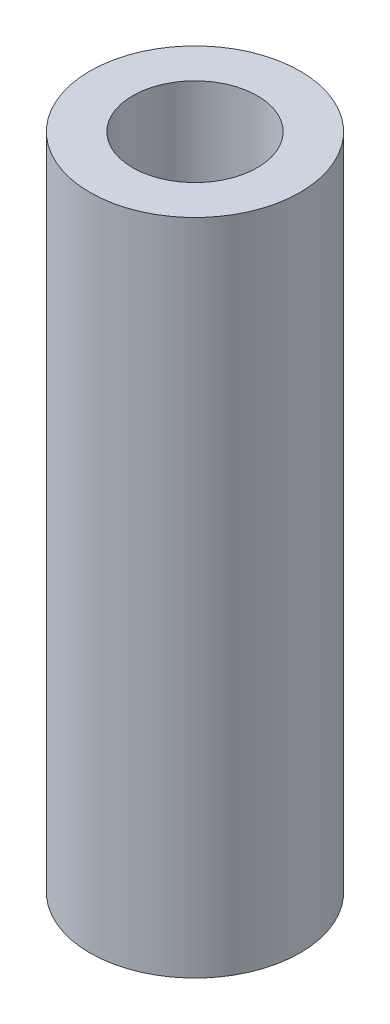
ISO-10303-21;
HEADER;
FILE_DESCRIPTION(('STEP AP214'),'2;1');
FILE_NAME('part.step','',(''),(''),'','','');
FILE_SCHEMA(('AUTOMOTIVE_DESIGN { 1 0 10303 214 1 1 1 1 }'));
ENDSEC;
DATA;
#1=APPLICATION_CONTEXT('core data for automotive mechanical design processes');
#2=APPLICATION_PROTOCOL_DEFINITION('international standard','automotive_design',2000,#1);
#3=PRODUCT_CONTEXT('',#1,'mechanical');
#4=PRODUCT('Part','Part','',(#3));
#5=PRODUCT_RELATED_PRODUCT_CATEGORY('part','',(#4));
#6=PRODUCT_DEFINITION_FORMATION('','',#4);
#7=PRODUCT_DEFINITION_CONTEXT('part definition',#1,'design');
#8=PRODUCT_DEFINITION('design','',#6,#7);
#9=PRODUCT_DEFINITION_SHAPE('','',#8);
#10=(LENGTH_UNIT() NAMED_UNIT(*) SI_UNIT(.MILLI.,.METRE.));
#11=(NAMED_UNIT(*) PLANE_ANGLE_UNIT() SI_UNIT($,.RADIAN.));
#12=(NAMED_UNIT(*) SI_UNIT($,.STERADIAN.) SOLID_ANGLE_UNIT());
#13=UNCERTAINTY_MEASURE_WITH_UNIT(LENGTH_MEASURE(1.E-05),#10,'distance_accuracy_value','');
#14=(GEOMETRIC_REPRESENTATION_CONTEXT(3) GLOBAL_UNCERTAINTY_ASSIGNED_CONTEXT((#13)) GLOBAL_UNIT_ASSIGNED_CONTEXT((#10,
#11,#12)) REPRESENTATION_CONTEXT('',''));
#15=CARTESIAN_POINT('',(0.,0.,0.));
#16=DIRECTION('',(0.,0.,1.));
#17=DIRECTION('',(1.,0.,0.));
#18=AXIS2_PLACEMENT_3D('',#15,#16,#17);
#19=CARTESIAN_POINT('',(0.,-119.38,0.));
#20=DIRECTION('',(0.,1.,0.));
#21=DIRECTION('',(0.,0.,1.));
#22=AXIS2_PLACEMENT_3D('',#19,#20,#21);
#23=CYLINDRICAL_SURFACE('',#22,11.303);
#24=CARTESIAN_POINT('',(0.,-95.25,0.));
#25=DIRECTION('',(0.,1.,0.));
#26=DIRECTION('',(-0.822983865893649,0.,0.568064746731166));
#27=AXIS2_PLACEMENT_3D('',#24,#25,#26);
#28=CIRCLE('',#27,11.303);
#29=CARTESIAN_POINT('',(-10.2512815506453,-95.25,4.76120106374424));
#30=VERTEX_POINT('',#29);
#31=CARTESIAN_POINT('',(-8.08695486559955,-95.25,7.89676959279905));
#32=VERTEX_POINT('',#31);
#33=EDGE_CURVE('E399',#30,#32,#28,.T.);
#34=ORIENTED_EDGE('',*,*,#33,.T.);
#35=DIRECTION('',(0.,1.,0.));
#36=VECTOR('',#35,1.);
#37=CARTESIAN_POINT('',(-8.08695486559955,-95.25,7.89676959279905));
#38=LINE('',#37,#36);
#39=CARTESIAN_POINT('',(-8.08695486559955,-25.4,7.89676959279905));
#40=VERTEX_POINT('',#39);
#41=EDGE_CURVE('E422',#32,#40,#38,.T.);
#42=ORIENTED_EDGE('',*,*,#41,.T.);
#43=CARTESIAN_POINT('',(0.,-25.4,0.));
#44=DIRECTION('',(0.,1.,0.));
#45=DIRECTION('',(-0.822983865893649,0.,0.568064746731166));
#46=AXIS2_PLACEMENT_3D('',#43,#44,#45);
#47=CIRCLE('',#46,11.303);
#48=CARTESIAN_POINT('',(-10.2512815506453,-25.4,4.76120106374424));
#49=VERTEX_POINT('',#48);
#50=EDGE_CURVE('E411',#49,#40,#47,.T.);
#51=ORIENTED_EDGE('',*,*,#50,.F.);
#52=DIRECTION('',(0.,1.,0.));
#53=VECTOR('',#52,1.);
#54=CARTESIAN_POINT('',(-10.2512815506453,-95.25,4.76120106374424));
#55=LINE('',#54,#53);
#56=EDGE_CURVE('E409',#30,#49,#55,.T.);
#57=ORIENTED_EDGE('',*,*,#56,.F.);
#58=EDGE_LOOP('',(#34,#42,#51,#57));
#59=FACE_BOUND('',#58,.T.);
#60=CARTESIAN_POINT('',(0.,-95.25,0.));
#61=DIRECTION('',(0.,1.,0.));
#62=DIRECTION('',(-0.935016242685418,0.,-0.354604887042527));
#63=AXIS2_PLACEMENT_3D('',#60,#61,#62);
#64=CIRCLE('',#63,11.303);
#65=CARTESIAN_POINT('',(-9.7417833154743,-95.25,-5.73196884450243));
#66=VERTEX_POINT('',#65);
#67=CARTESIAN_POINT('',(-11.0928279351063,-95.25,-2.16955695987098));
#68=VERTEX_POINT('',#67);
#69=EDGE_CURVE('E462',#66,#68,#64,.T.);
#70=ORIENTED_EDGE('',*,*,#69,.T.);
#71=DIRECTION('',(0.,1.,0.));
#72=VECTOR('',#71,1.);
#73=CARTESIAN_POINT('',(-11.0928279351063,-95.25,-2.16955695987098));
#74=LINE('',#73,#72);
#75=CARTESIAN_POINT('',(-11.0928279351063,-25.4,-2.16955695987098));
#76=VERTEX_POINT('',#75);
#77=EDGE_CURVE('E487',#68,#76,#74,.T.);
#78=ORIENTED_EDGE('',*,*,#77,.T.);
#79=CARTESIAN_POINT('',(0.,-25.4,0.));
#80=DIRECTION('',(0.,1.,0.));
#81=DIRECTION('',(-0.935016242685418,0.,-0.354604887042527));
#82=AXIS2_PLACEMENT_3D('',#79,#80,#81);
#83=CIRCLE('',#82,11.303);
#84=CARTESIAN_POINT('',(-9.7417833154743,-25.4,-5.73196884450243));
#85=VERTEX_POINT('',#84);
#86=EDGE_CURVE('E474',#85,#76,#83,.T.);
#87=ORIENTED_EDGE('',*,*,#86,.F.);
#88=DIRECTION('',(0.,1.,0.));
#89=VECTOR('',#88,1.);
#90=CARTESIAN_POINT('',(-9.7417833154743,-95.25,-5.73196884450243));
#91=LINE('',#90,#89);
#92=EDGE_CURVE('E472',#66,#85,#91,.T.);
#93=ORIENTED_EDGE('',*,*,#92,.F.);
#94=EDGE_LOOP('',(#70,#78,#87,#93));
#95=FACE_BOUND('',#94,.T.);
#96=CARTESIAN_POINT('',(0.,-95.25,0.));
#97=DIRECTION('',(0.,1.,0.));
#98=DIRECTION('',(-0.239315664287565,0.,-0.97094181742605));
#99=AXIS2_PLACEMENT_3D('',#96,#97,#98);
#100=CIRCLE('',#99,11.303);
#101=CARTESIAN_POINT('',(-0.816645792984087,-95.25,-11.2734599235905));
#102=VERTEX_POINT('',#101);
#103=CARTESIAN_POINT('',(-4.51593411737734,-95.25,-10.3616672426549));
#104=VERTEX_POINT('',#103);
#105=EDGE_CURVE('E528',#102,#104,#100,.T.);
#106=ORIENTED_EDGE('',*,*,#105,.T.);
#107=DIRECTION('',(0.,1.,0.));
#108=VECTOR('',#107,1.);
#109=CARTESIAN_POINT('',(-4.51593411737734,-95.25,-10.3616672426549));
#110=LINE('',#109,#108);
#111=CARTESIAN_POINT('',(-4.51593411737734,-25.4,-10.3616672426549));
#112=VERTEX_POINT('',#111);
#113=EDGE_CURVE('E553',#104,#112,#110,.T.);
#114=ORIENTED_EDGE('',*,*,#113,.T.);
#115=CARTESIAN_POINT('',(0.,-25.4,0.));
#116=DIRECTION('',(0.,1.,0.));
#117=DIRECTION('',(-0.239315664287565,0.,-0.97094181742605));
#118=AXIS2_PLACEMENT_3D('',#115,#116,#117);
#119=CIRCLE('',#118,11.303);
#120=CARTESIAN_POINT('',(-0.816645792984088,-25.4,-11.2734599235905));
#121=VERTEX_POINT('',#120);
#122=EDGE_CURVE('E540',#121,#112,#119,.T.);
#123=ORIENTED_EDGE('',*,*,#122,.F.);
#124=DIRECTION('',(0.,1.,0.));
#125=VECTOR('',#124,1.);
#126=CARTESIAN_POINT('',(-0.816645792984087,-95.25,-11.2734599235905));
#127=LINE('',#126,#125);
#128=EDGE_CURVE('E538',#102,#121,#127,.T.);
#129=ORIENTED_EDGE('',*,*,#128,.F.);
#130=EDGE_LOOP('',(#106,#114,#123,#129));
#131=FACE_BOUND('',#130,.T.);
#132=CARTESIAN_POINT('',(0.,-95.25,0.));
#133=DIRECTION('',(0.,1.,0.));
#134=DIRECTION('',(0.663122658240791,0.,-0.748510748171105));
#135=AXIS2_PLACEMENT_3D('',#132,#133,#134);
#136=CIRCLE('',#135,11.303);
#137=CARTESIAN_POINT('',(8.81396794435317,-95.25,-7.07614146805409));
#138=VERTEX_POINT('',#137);
#139=CARTESIAN_POINT('',(5.96214199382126,-95.25,-9.60263879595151));
#140=VERTEX_POINT('',#139);
#141=EDGE_CURVE('E594',#138,#140,#136,.T.);
#142=ORIENTED_EDGE('',*,*,#141,.T.);
#143=DIRECTION('',(0.,1.,0.));
#144=VECTOR('',#143,1.);
#145=CARTESIAN_POINT('',(5.96214199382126,-95.25,-9.60263879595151));
#146=LINE('',#145,#144);
#147=CARTESIAN_POINT('',(5.96214199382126,-25.4,-9.60263879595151));
#148=VERTEX_POINT('',#147);
#149=EDGE_CURVE('E619',#140,#148,#146,.T.);
#150=ORIENTED_EDGE('',*,*,#149,.T.);
#151=CARTESIAN_POINT('',(0.,-25.4,0.));
#152=DIRECTION('',(0.,1.,0.));
#153=DIRECTION('',(0.663122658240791,0.,-0.748510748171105));
#154=AXIS2_PLACEMENT_3D('',#151,#152,#153);
#155=CIRCLE('',#154,11.303);
#156=CARTESIAN_POINT('',(8.81396794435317,-25.4,-7.07614146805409));
#157=VERTEX_POINT('',#156);
#158=EDGE_CURVE('E606',#157,#148,#155,.T.);
#159=ORIENTED_EDGE('',*,*,#158,.F.);
#160=DIRECTION('',(0.,1.,0.));
#161=VECTOR('',#160,1.);
#162=CARTESIAN_POINT('',(8.81396794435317,-95.25,-7.07614146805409));
#163=LINE('',#162,#161);
#164=EDGE_CURVE('E604',#138,#157,#163,.T.);
#165=ORIENTED_EDGE('',*,*,#164,.F.);
#166=EDGE_LOOP('',(#142,#150,#159,#165));
#167=FACE_BOUND('',#166,.T.);
#168=CARTESIAN_POINT('',(0.,-95.25,0.));
#169=DIRECTION('',(0.,1.,0.));
#170=DIRECTION('',(0.992708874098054,0.,0.12053668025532));
#171=AXIS2_PLACEMENT_3D('',#168,#169,#170);
#172=CIRCLE('',#171,11.303);
#173=CARTESIAN_POINT('',(10.8304547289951,-95.25,3.23404690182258));
#174=VERTEX_POINT('',#173);
#175=CARTESIAN_POINT('',(11.2896994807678,-95.25,-0.548173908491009));
#176=VERTEX_POINT('',#175);
#177=EDGE_CURVE('E660',#174,#176,#172,.T.);
#178=ORIENTED_EDGE('',*,*,#177,.T.);
#179=DIRECTION('',(0.,1.,0.));
#180=VECTOR('',#179,1.);
#181=CARTESIAN_POINT('',(11.2896994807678,-95.25,-0.548173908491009));
#182=LINE('',#181,#180);
#183=CARTESIAN_POINT('',(11.2896994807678,-25.4,-0.548173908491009));
#184=VERTEX_POINT('',#183);
#185=EDGE_CURVE('E685',#176,#184,#182,.T.);
#186=ORIENTED_EDGE('',*,*,#185,.T.);
#187=CARTESIAN_POINT('',(0.,-25.4,0.));
#188=DIRECTION('',(0.,1.,0.));
#189=DIRECTION('',(0.992708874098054,0.,0.12053668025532));
#190=AXIS2_PLACEMENT_3D('',#187,#188,#189);
#191=CIRCLE('',#190,11.303);
#192=CARTESIAN_POINT('',(10.8304547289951,-25.4,3.23404690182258));
#193=VERTEX_POINT('',#192);
#194=EDGE_CURVE('E672',#193,#184,#191,.T.);
#195=ORIENTED_EDGE('',*,*,#194,.F.);
#196=DIRECTION('',(0.,1.,0.));
#197=VECTOR('',#196,1.);
#198=CARTESIAN_POINT('',(10.8304547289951,-95.25,3.23404690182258));
#199=LINE('',#198,#197);
#200=EDGE_CURVE('E670',#174,#193,#199,.T.);
#201=ORIENTED_EDGE('',*,*,#200,.F.);
#202=EDGE_LOOP('',(#178,#186,#195,#201));
#203=FACE_BOUND('',#202,.T.);
#204=CARTESIAN_POINT('',(0.,-95.25,0.));
#205=DIRECTION('',(0.,1.,0.));
#206=DIRECTION('',(0.46472317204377,0.,0.885456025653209));
#207=AXIS2_PLACEMENT_3D('',#204,#205,#206);
#208=CIRCLE('',#207,11.303);
#209=CARTESIAN_POINT('',(3.49083110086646,-95.25,10.7504375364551));
#210=VERTEX_POINT('',#209);
#211=CARTESIAN_POINT('',(6.86441855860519,-95.25,8.97984225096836));
#212=VERTEX_POINT('',#211);
#213=EDGE_CURVE('E726',#210,#212,#208,.T.);
#214=ORIENTED_EDGE('',*,*,#213,.T.);
#215=DIRECTION('',(0.,1.,0.));
#216=VECTOR('',#215,1.);
#217=CARTESIAN_POINT('',(6.86441855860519,-95.25,8.97984225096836));
#218=LINE('',#217,#216);
#219=CARTESIAN_POINT('',(6.86441855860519,-25.4,8.97984225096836));
#220=VERTEX_POINT('',#219);
#221=EDGE_CURVE('E751',#212,#220,#218,.T.);
#222=ORIENTED_EDGE('',*,*,#221,.T.);
#223=CARTESIAN_POINT('',(0.,-25.4,0.));
#224=DIRECTION('',(0.,1.,0.));
#225=DIRECTION('',(0.46472317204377,0.,0.885456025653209));
#226=AXIS2_PLACEMENT_3D('',#223,#224,#225);
#227=CIRCLE('',#226,11.303);
#228=CARTESIAN_POINT('',(3.49083110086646,-25.4,10.7504375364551));
#229=VERTEX_POINT('',#228);
#230=EDGE_CURVE('E738',#229,#220,#227,.T.);
#231=ORIENTED_EDGE('',*,*,#230,.F.);
#232=DIRECTION('',(0.,1.,0.));
#233=VECTOR('',#232,1.);
#234=CARTESIAN_POINT('',(3.49083110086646,-95.25,10.7504375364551));
#235=LINE('',#234,#233);
#236=EDGE_CURVE('E736',#210,#229,#235,.T.);
#237=ORIENTED_EDGE('',*,*,#236,.F.);
#238=EDGE_LOOP('',(#214,#222,#231,#237));
#239=FACE_BOUND('',#238,.T.);
#240=CARTESIAN_POINT('',(0.,0.,0.));
#241=DIRECTION('',(0.,1.,0.));
#242=DIRECTION('',(0.,0.,1.));
#243=AXIS2_PLACEMENT_3D('',#240,#241,#242);
#244=CIRCLE('',#243,11.303);
#245=CARTESIAN_POINT('',(0.,0.,11.303));
#246=VERTEX_POINT('',#245);
#247=EDGE_CURVE('E781',#246,#246,#244,.T.);
#248=ORIENTED_EDGE('',*,*,#247,.T.);
#249=EDGE_LOOP('',(#248));
#250=FACE_BOUND('',#249,.T.);
#251=CARTESIAN_POINT('',(0.,-119.38,0.));
#252=DIRECTION('',(0.,1.,0.));
#253=DIRECTION('',(0.,0.,1.));
#254=AXIS2_PLACEMENT_3D('',#251,#252,#253);
#255=CIRCLE('',#254,11.303);
#256=CARTESIAN_POINT('',(0.,-119.38,11.303));
#257=VERTEX_POINT('',#256);
#258=EDGE_CURVE('E789',#257,#257,#255,.T.);
#259=ORIENTED_EDGE('',*,*,#258,.F.);
#260=EDGE_LOOP('',(#259));
#261=FACE_BOUND('',#260,.T.);
#262=CARTESIAN_POINT('',(0.,-95.25,0.));
#263=DIRECTION('',(0.,1.,0.));
#264=DIRECTION('',(0.,0.,1.));
#265=AXIS2_PLACEMENT_3D('',#262,#263,#264);
#266=CIRCLE('',#265,11.303);
#267=CARTESIAN_POINT('',(-1.905,-95.25,11.1413097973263));
#268=VERTEX_POINT('',#267);
#269=CARTESIAN_POINT('',(1.905,-95.25,11.1413097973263));
#270=VERTEX_POINT('',#269);
#271=EDGE_CURVE('E759',#268,#270,#266,.T.);
#272=ORIENTED_EDGE('',*,*,#271,.T.);
#273=DIRECTION('',(0.,1.,0.));
#274=VECTOR('',#273,1.);
#275=CARTESIAN_POINT('',(1.905,-95.25,11.1413097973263));
#276=LINE('',#275,#274);
#277=CARTESIAN_POINT('',(1.905,-25.4,11.1413097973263));
#278=VERTEX_POINT('',#277);
#279=EDGE_CURVE('E784',#270,#278,#276,.T.);
#280=ORIENTED_EDGE('',*,*,#279,.T.);
#281=CARTESIAN_POINT('',(0.,-25.4,0.));
#282=DIRECTION('',(0.,1.,0.));
#283=DIRECTION('',(0.,0.,1.));
#284=AXIS2_PLACEMENT_3D('',#281,#282,#283);
#285=CIRCLE('',#284,11.303);
#286=CARTESIAN_POINT('',(-1.905,-25.4,11.1413097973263));
#287=VERTEX_POINT('',#286);
#288=EDGE_CURVE('E771',#287,#278,#285,.T.);
#289=ORIENTED_EDGE('',*,*,#288,.F.);
#290=DIRECTION('',(0.,1.,0.));
#291=VECTOR('',#290,1.);
#292=CARTESIAN_POINT('',(-1.905,-95.25,11.1413097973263));
#293=LINE('',#292,#291);
#294=EDGE_CURVE('E769',#268,#287,#293,.T.);
#295=ORIENTED_EDGE('',*,*,#294,.F.);
#296=EDGE_LOOP('',(#272,#280,#289,#295));
#297=FACE_BOUND('',#296,.T.);
#298=CARTESIAN_POINT('',(0.,-95.25,0.));
#299=DIRECTION('',(0.,1.,0.));
#300=DIRECTION('',(0.822983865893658,0.,0.568064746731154));
#301=AXIS2_PLACEMENT_3D('',#298,#299,#300);
#302=CIRCLE('',#301,11.303);
#303=CARTESIAN_POINT('',(8.08695486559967,-95.25,7.89676959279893));
#304=VERTEX_POINT('',#303);
#305=CARTESIAN_POINT('',(10.2512815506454,-95.25,4.76120106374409));
#306=VERTEX_POINT('',#305);
#307=EDGE_CURVE('E693',#304,#306,#302,.T.);
#308=ORIENTED_EDGE('',*,*,#307,.T.);
#309=DIRECTION('',(0.,1.,0.));
#310=VECTOR('',#309,1.);
#311=CARTESIAN_POINT('',(10.2512815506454,-95.25,4.76120106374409));
#312=LINE('',#311,#310);
#313=CARTESIAN_POINT('',(10.2512815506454,-25.4,4.76120106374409));
#314=VERTEX_POINT('',#313);
#315=EDGE_CURVE('E718',#306,#314,#312,.T.);
#316=ORIENTED_EDGE('',*,*,#315,.T.);
#317=CARTESIAN_POINT('',(0.,-25.4,0.));
#318=DIRECTION('',(0.,1.,0.));
#319=DIRECTION('',(0.822983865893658,0.,0.568064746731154));
#320=AXIS2_PLACEMENT_3D('',#317,#318,#319);
#321=CIRCLE('',#320,11.303);
#322=CARTESIAN_POINT('',(8.08695486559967,-25.4,7.89676959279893));
#323=VERTEX_POINT('',#322);
#324=EDGE_CURVE('E705',#323,#314,#321,.T.);
#325=ORIENTED_EDGE('',*,*,#324,.F.);
#326=DIRECTION('',(0.,1.,0.));
#327=VECTOR('',#326,1.);
#328=CARTESIAN_POINT('',(8.08695486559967,-95.25,7.89676959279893));
#329=LINE('',#328,#327);
#330=EDGE_CURVE('E703',#304,#323,#329,.T.);
#331=ORIENTED_EDGE('',*,*,#330,.F.);
#332=EDGE_LOOP('',(#308,#316,#325,#331));
#333=FACE_BOUND('',#332,.T.);
#334=CARTESIAN_POINT('',(0.,-95.25,0.));
#335=DIRECTION('',(0.,1.,0.));
#336=DIRECTION('',(0.935016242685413,0.,-0.35460488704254));
#337=AXIS2_PLACEMENT_3D('',#334,#335,#336);
#338=CIRCLE('',#337,11.303);
#339=CARTESIAN_POINT('',(11.0928279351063,-95.25,-2.16955695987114));
#340=VERTEX_POINT('',#339);
#341=CARTESIAN_POINT('',(9.74178331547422,-95.25,-5.73196884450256));
#342=VERTEX_POINT('',#341);
#343=EDGE_CURVE('E627',#340,#342,#338,.T.);
#344=ORIENTED_EDGE('',*,*,#343,.T.);
#345=DIRECTION('',(0.,1.,0.));
#346=VECTOR('',#345,1.);
#347=CARTESIAN_POINT('',(9.74178331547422,-95.25,-5.73196884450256));
#348=LINE('',#347,#346);
#349=CARTESIAN_POINT('',(9.74178331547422,-25.4,-5.73196884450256));
#350=VERTEX_POINT('',#349);
#351=EDGE_CURVE('E652',#342,#350,#348,.T.);
#352=ORIENTED_EDGE('',*,*,#351,.T.);
#353=CARTESIAN_POINT('',(0.,-25.4,0.));
#354=DIRECTION('',(0.,1.,0.));
#355=DIRECTION('',(0.935016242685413,0.,-0.35460488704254));
#356=AXIS2_PLACEMENT_3D('',#353,#354,#355);
#357=CIRCLE('',#356,11.303);
#358=CARTESIAN_POINT('',(11.0928279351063,-25.4,-2.16955695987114));
#359=VERTEX_POINT('',#358);
#360=EDGE_CURVE('E639',#359,#350,#357,.T.);
#361=ORIENTED_EDGE('',*,*,#360,.F.);
#362=DIRECTION('',(0.,1.,0.));
#363=VECTOR('',#362,1.);
#364=CARTESIAN_POINT('',(11.0928279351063,-95.25,-2.16955695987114));
#365=LINE('',#364,#363);
#366=EDGE_CURVE('E637',#340,#359,#365,.T.);
#367=ORIENTED_EDGE('',*,*,#366,.F.);
#368=EDGE_LOOP('',(#344,#352,#361,#367));
#369=FACE_BOUND('',#368,.T.);
#370=CARTESIAN_POINT('',(0.,-95.25,0.));
#371=DIRECTION('',(0.,1.,0.));
#372=DIRECTION('',(0.239315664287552,0.,-0.970941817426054));
#373=AXIS2_PLACEMENT_3D('',#370,#371,#372);
#374=CIRCLE('',#373,11.303);
#375=CARTESIAN_POINT('',(4.51593411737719,-95.25,-10.3616672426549));
#376=VERTEX_POINT('',#375);
#377=CARTESIAN_POINT('',(0.816645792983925,-95.25,-11.2734599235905));
#378=VERTEX_POINT('',#377);
#379=EDGE_CURVE('E561',#376,#378,#374,.T.);
#380=ORIENTED_EDGE('',*,*,#379,.T.);
#381=DIRECTION('',(0.,1.,0.));
#382=VECTOR('',#381,1.);
#383=CARTESIAN_POINT('',(0.816645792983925,-95.25,-11.2734599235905));
#384=LINE('',#383,#382);
#385=CARTESIAN_POINT('',(0.816645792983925,-25.4,-11.2734599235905));
#386=VERTEX_POINT('',#385);
#387=EDGE_CURVE('E586',#378,#386,#384,.T.);
#388=ORIENTED_EDGE('',*,*,#387,.T.);
#389=CARTESIAN_POINT('',(0.,-25.4,0.));
#390=DIRECTION('',(0.,1.,0.));
#391=DIRECTION('',(0.239315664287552,0.,-0.970941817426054));
#392=AXIS2_PLACEMENT_3D('',#389,#390,#391);
#393=CIRCLE('',#392,11.303);
#394=CARTESIAN_POINT('',(4.51593411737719,-25.4,-10.3616672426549));
#395=VERTEX_POINT('',#394);
#396=EDGE_CURVE('E573',#395,#386,#393,.T.);
#397=ORIENTED_EDGE('',*,*,#396,.F.);
#398=DIRECTION('',(0.,1.,0.));
#399=VECTOR('',#398,1.);
#400=CARTESIAN_POINT('',(4.51593411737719,-95.25,-10.3616672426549));
#401=LINE('',#400,#399);
#402=EDGE_CURVE('E571',#376,#395,#401,.T.);
#403=ORIENTED_EDGE('',*,*,#402,.F.);
#404=EDGE_LOOP('',(#380,#388,#397,#403));
#405=FACE_BOUND('',#404,.T.);
#406=CARTESIAN_POINT('',(0.,-95.25,0.));
#407=DIRECTION('',(0.,1.,0.));
#408=DIRECTION('',(-0.663122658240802,0.,-0.748510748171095));
#409=AXIS2_PLACEMENT_3D('',#406,#407,#408);
#410=CIRCLE('',#409,11.303);
#411=CARTESIAN_POINT('',(-5.96214199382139,-95.25,-9.60263879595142));
#412=VERTEX_POINT('',#411);
#413=CARTESIAN_POINT('',(-8.81396794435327,-95.25,-7.07614146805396));
#414=VERTEX_POINT('',#413);
#415=EDGE_CURVE('E495',#412,#414,#410,.T.);
#416=ORIENTED_EDGE('',*,*,#415,.T.);
#417=DIRECTION('',(0.,1.,0.));
#418=VECTOR('',#417,1.);
#419=CARTESIAN_POINT('',(-8.81396794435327,-95.25,-7.07614146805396));
#420=LINE('',#419,#418);
#421=CARTESIAN_POINT('',(-8.81396794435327,-25.4,-7.07614146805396));
#422=VERTEX_POINT('',#421);
#423=EDGE_CURVE('E520',#414,#422,#420,.T.);
#424=ORIENTED_EDGE('',*,*,#423,.T.);
#425=CARTESIAN_POINT('',(0.,-25.4,0.));
#426=DIRECTION('',(0.,1.,0.));
#427=DIRECTION('',(-0.663122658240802,0.,-0.748510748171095));
#428=AXIS2_PLACEMENT_3D('',#425,#426,#427);
#429=CIRCLE('',#428,11.303);
#430=CARTESIAN_POINT('',(-5.96214199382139,-25.4,-9.60263879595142));
#431=VERTEX_POINT('',#430);
#432=EDGE_CURVE('E507',#431,#422,#429,.T.);
#433=ORIENTED_EDGE('',*,*,#432,.F.);
#434=DIRECTION('',(0.,1.,0.));
#435=VECTOR('',#434,1.);
#436=CARTESIAN_POINT('',(-5.96214199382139,-95.25,-9.60263879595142));
#437=LINE('',#436,#435);
#438=EDGE_CURVE('E505',#412,#431,#437,.T.);
#439=ORIENTED_EDGE('',*,*,#438,.F.);
#440=EDGE_LOOP('',(#416,#424,#433,#439));
#441=FACE_BOUND('',#440,.T.);
#442=CARTESIAN_POINT('',(0.,-95.25,0.));
#443=DIRECTION('',(0.,1.,0.));
#444=DIRECTION('',(-0.992708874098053,0.,0.120536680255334));
#445=AXIS2_PLACEMENT_3D('',#442,#443,#444);
#446=CIRCLE('',#445,11.303);
#447=CARTESIAN_POINT('',(-11.2896994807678,-95.25,-0.548173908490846));
#448=VERTEX_POINT('',#447);
#449=CARTESIAN_POINT('',(-10.830454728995,-95.25,3.23404690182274));
#450=VERTEX_POINT('',#449);
#451=EDGE_CURVE('E429',#448,#450,#446,.T.);
#452=ORIENTED_EDGE('',*,*,#451,.T.);
#453=DIRECTION('',(0.,1.,0.));
#454=VECTOR('',#453,1.);
#455=CARTESIAN_POINT('',(-10.830454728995,-95.25,3.23404690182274));
#456=LINE('',#455,#454);
#457=CARTESIAN_POINT('',(-10.830454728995,-25.4,3.23404690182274));
#458=VERTEX_POINT('',#457);
#459=EDGE_CURVE('E454',#450,#458,#456,.T.);
#460=ORIENTED_EDGE('',*,*,#459,.T.);
#461=CARTESIAN_POINT('',(0.,-25.4,0.));
#462=DIRECTION('',(0.,1.,0.));
#463=DIRECTION('',(-0.992708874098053,0.,0.120536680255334));
#464=AXIS2_PLACEMENT_3D('',#461,#462,#463);
#465=CIRCLE('',#464,11.303);
#466=CARTESIAN_POINT('',(-11.2896994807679,-25.4,-0.548173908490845));
#467=VERTEX_POINT('',#466);
#468=EDGE_CURVE('E441',#467,#458,#465,.T.);
#469=ORIENTED_EDGE('',*,*,#468,.F.);
#470=DIRECTION('',(0.,1.,0.));
#471=VECTOR('',#470,1.);
#472=CARTESIAN_POINT('',(-11.2896994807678,-95.25,-0.548173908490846));
#473=LINE('',#472,#471);
#474=EDGE_CURVE('E439',#448,#467,#473,.T.);
#475=ORIENTED_EDGE('',*,*,#474,.F.);
#476=EDGE_LOOP('',(#452,#460,#469,#475));
#477=FACE_BOUND('',#476,.T.);
#478=CARTESIAN_POINT('',(0.,-95.25,0.));
#479=DIRECTION('',(0.,1.,0.));
#480=DIRECTION('',(-0.464723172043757,0.,0.885456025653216));
#481=AXIS2_PLACEMENT_3D('',#478,#479,#480);
#482=CIRCLE('',#481,11.303);
#483=CARTESIAN_POINT('',(-6.86441855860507,-95.25,8.97984225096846));
#484=VERTEX_POINT('',#483);
#485=CARTESIAN_POINT('',(-3.49083110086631,-95.25,10.7504375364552));
#486=VERTEX_POINT('',#485);
#487=EDGE_CURVE('E368',#484,#486,#482,.T.);
#488=ORIENTED_EDGE('',*,*,#487,.T.);
#489=DIRECTION('',(0.,1.,0.));
#490=VECTOR('',#489,1.);
#491=CARTESIAN_POINT('',(-3.49083110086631,-95.25,10.7504375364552));
#492=LINE('',#491,#490);
#493=CARTESIAN_POINT('',(-3.49083110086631,-25.4,10.7504375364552));
#494=VERTEX_POINT('',#493);
#495=EDGE_CURVE('E388',#486,#494,#492,.T.);
#496=ORIENTED_EDGE('',*,*,#495,.T.);
#497=CARTESIAN_POINT('',(0.,-25.4,0.));
#498=DIRECTION('',(0.,1.,0.));
#499=DIRECTION('',(-0.464723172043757,0.,0.885456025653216));
#500=AXIS2_PLACEMENT_3D('',#497,#498,#499);
#501=CIRCLE('',#500,11.303);
#502=CARTESIAN_POINT('',(-6.86441855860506,-25.4,8.97984225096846));
#503=VERTEX_POINT('',#502);
#504=EDGE_CURVE('E387',#503,#494,#501,.T.);
#505=ORIENTED_EDGE('',*,*,#504,.F.);
#506=DIRECTION('',(0.,1.,0.));
#507=VECTOR('',#506,1.);
#508=CARTESIAN_POINT('',(-6.86441855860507,-95.25,8.97984225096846));
#509=LINE('',#508,#507);
#510=EDGE_CURVE('E382',#484,#503,#509,.T.);
#511=ORIENTED_EDGE('',*,*,#510,.F.);
#512=EDGE_LOOP('',(#488,#496,#505,#511));
#513=FACE_BOUND('',#512,.T.);
#514=ADVANCED_FACE('F34',(#59,#95,#131,#167,#203,#239,#250,#261,#297,#333,#369,#405,#441,#477,
#513),#23,.F.);
#515=CARTESIAN_POINT('',(0.,-119.38,0.));
#516=DIRECTION('',(0.,1.,0.));
#517=DIRECTION('',(0.,0.,1.));
#518=AXIS2_PLACEMENT_3D('',#515,#516,#517);
#519=CYLINDRICAL_SURFACE('',#518,19.05);
#520=CARTESIAN_POINT('',(0.,-119.38,0.));
#521=DIRECTION('',(0.,1.,0.));
#522=DIRECTION('',(0.,0.,1.));
#523=AXIS2_PLACEMENT_3D('',#520,#521,#522);
#524=CIRCLE('',#523,19.05);
#525=CARTESIAN_POINT('',(0.,-119.38,19.05));
#526=VERTEX_POINT('',#525);
#527=EDGE_CURVE('E11',#526,#526,#524,.T.);
#528=CARTESIAN_POINT('',(0.,0.,0.));
#529=DIRECTION('',(0.,1.,0.));
#530=DIRECTION('',(0.,0.,1.));
#531=AXIS2_PLACEMENT_3D('',#528,#529,#530);
#532=CIRCLE('',#531,19.05);
#533=CARTESIAN_POINT('',(0.,0.,19.05));
#534=VERTEX_POINT('',#533);
#535=EDGE_CURVE('E38',#534,#534,#532,.T.);
#536=CARTESIAN_POINT('',(0.,-119.38,19.05));
#537=CARTESIAN_POINT('',(0.,-118.136458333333,19.05));
#538=CARTESIAN_POINT('',(0.,-116.892916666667,19.05));
#539=CARTESIAN_POINT('',(0.,-114.405833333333,19.05));
#540=CARTESIAN_POINT('',(0.,-113.162291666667,19.05));
#541=CARTESIAN_POINT('',(0.,-110.675208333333,19.05));
#542=CARTESIAN_POINT('',(0.,-109.431666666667,19.05));
#543=CARTESIAN_POINT('',(0.,-106.944583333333,19.05));
#544=CARTESIAN_POINT('',(0.,-105.701041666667,19.05));
#545=CARTESIAN_POINT('',(0.,-103.213958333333,19.05));
#546=CARTESIAN_POINT('',(0.,-101.970416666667,19.05));
#547=CARTESIAN_POINT('',(0.,-99.4833333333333,19.05));
#548=CARTESIAN_POINT('',(0.,-98.2397916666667,19.05));
#549=CARTESIAN_POINT('',(0.,-95.7527083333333,19.05));
#550=CARTESIAN_POINT('',(0.,-94.5091666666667,19.05));
#551=CARTESIAN_POINT('',(0.,-92.0220833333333,19.05));
#552=CARTESIAN_POINT('',(0.,-90.7785416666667,19.05));
#553=CARTESIAN_POINT('',(0.,-88.2914583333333,19.05));
#554=CARTESIAN_POINT('',(0.,-87.0479166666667,19.05));
#555=CARTESIAN_POINT('',(0.,-84.5608333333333,19.05));
#556=CARTESIAN_POINT('',(0.,-83.3172916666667,19.05));
#557=CARTESIAN_POINT('',(0.,-80.8302083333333,19.05));
#558=CARTESIAN_POINT('',(0.,-79.5866666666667,19.05));
#559=CARTESIAN_POINT('',(0.,-77.0995833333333,19.05));
#560=CARTESIAN_POINT('',(0.,-75.8560416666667,19.05));
#561=CARTESIAN_POINT('',(0.,-73.3689583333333,19.05));
#562=CARTESIAN_POINT('',(0.,-72.1254166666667,19.05));
#563=CARTESIAN_POINT('',(0.,-69.6383333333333,19.05));
#564=CARTESIAN_POINT('',(0.,-68.3947916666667,19.05));
#565=CARTESIAN_POINT('',(0.,-65.9077083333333,19.05));
#566=CARTESIAN_POINT('',(0.,-64.6641666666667,19.05));
#567=CARTESIAN_POINT('',(0.,-62.1770833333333,19.05));
#568=CARTESIAN_POINT('',(0.,-60.9335416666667,19.05));
#569=CARTESIAN_POINT('',(0.,-58.4464583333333,19.05));
#570=CARTESIAN_POINT('',(0.,-57.2029166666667,19.05));
#571=CARTESIAN_POINT('',(0.,-54.7158333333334,19.05));
#572=CARTESIAN_POINT('',(0.,-53.4722916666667,19.05));
#573=CARTESIAN_POINT('',(0.,-50.9852083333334,19.05));
#574=CARTESIAN_POINT('',(0.,-49.7416666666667,19.05));
#575=CARTESIAN_POINT('',(0.,-47.2545833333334,19.05));
#576=CARTESIAN_POINT('',(0.,-46.0110416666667,19.05));
#577=CARTESIAN_POINT('',(0.,-43.5239583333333,19.05));
#578=CARTESIAN_POINT('',(0.,-42.2804166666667,19.05));
#579=CARTESIAN_POINT('',(0.,-39.7933333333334,19.05));
#580=CARTESIAN_POINT('',(0.,-38.5497916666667,19.05));
#581=CARTESIAN_POINT('',(0.,-36.0627083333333,19.05));
#582=CARTESIAN_POINT('',(0.,-34.8191666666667,19.05));
#583=CARTESIAN_POINT('',(0.,-32.3320833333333,19.05));
#584=CARTESIAN_POINT('',(0.,-31.0885416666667,19.05));
#585=CARTESIAN_POINT('',(0.,-28.6014583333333,19.05));
#586=CARTESIAN_POINT('',(0.,-27.3579166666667,19.05));
#587=CARTESIAN_POINT('',(0.,-24.8708333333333,19.05));
#588=CARTESIAN_POINT('',(0.,-23.6272916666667,19.05));
#589=CARTESIAN_POINT('',(0.,-21.1402083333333,19.05));
#590=CARTESIAN_POINT('',(0.,-19.8966666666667,19.05));
#591=CARTESIAN_POINT('',(0.,-17.4095833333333,19.05));
#592=CARTESIAN_POINT('',(0.,-16.1660416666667,19.05));
#593=CARTESIAN_POINT('',(0.,-13.6789583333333,19.05));
#594=CARTESIAN_POINT('',(0.,-12.4354166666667,19.05));
#595=CARTESIAN_POINT('',(0.,-9.94833333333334,19.05));
#596=CARTESIAN_POINT('',(0.,-8.70479166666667,19.05));
#597=CARTESIAN_POINT('',(0.,-6.21770833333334,19.05));
#598=CARTESIAN_POINT('',(0.,-4.97416666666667,19.05));
#599=CARTESIAN_POINT('',(0.,-2.48708333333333,19.05));
#600=CARTESIAN_POINT('',(0.,-1.24354166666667,19.05));
#601=CARTESIAN_POINT('',(0.,0.,19.05));
#602=B_SPLINE_CURVE_WITH_KNOTS('',3,(#536,#537,#538,#539,#540,#541,#542,#543,#544,#545,#546,
#547,#548,#549,#550,#551,#552,#553,#554,#555,#556,#557,#558,#559,#560,#561,#562,#563,#564,#565,
#566,#567,#568,#569,#570,#571,#572,#573,#574,#575,#576,#577,#578,#579,#580,#581,#582,#583,#584,
#585,#586,#587,#588,#589,#590,#591,#592,#593,#594,#595,#596,#597,#598,#599,#600,#601),
.UNSPECIFIED.,.F.,.F.,(4,2,2,2,2,2,2,2,2,2,2,2,2,2,2,2,2,2,2,2,2,2,2,2,2,2,2,2,2,2,2,2,4),(0.,
3.730625,7.46125,11.191875,14.9225,18.653125,22.38375,26.114375,29.845,33.575625,37.30625,
41.036875,44.7675,48.498125,52.22875,55.959375,59.69,63.420625,67.15125,70.881875,74.6125,
78.343125,82.07375,85.804375,89.535,93.265625,96.99625,100.726875,104.4575,108.188125,111.91875,
115.649375,119.38),.UNSPECIFIED.);
#603=EDGE_CURVE('BSEAM36',#526,#534,#602,.T.);
#604=ORIENTED_EDGE('',*,*,#527,.T.);
#605=ORIENTED_EDGE('',*,*,#535,.F.);
#606=ORIENTED_EDGE('',*,*,#603,.T.);
#607=ORIENTED_EDGE('',*,*,#603,.F.);
#608=EDGE_LOOP('',(#604,#606,#605,#607));
#609=FACE_BOUND('',#608,.T.);
#610=ADVANCED_FACE('F36',(#609),#519,.T.);
#611=CARTESIAN_POINT('',(0.,-119.38,0.));
#612=DIRECTION('',(0.,1.,0.));
#613=DIRECTION('',(0.,0.,1.));
#614=AXIS2_PLACEMENT_3D('',#611,#612,#613);
#615=PLANE('',#614);
#616=ORIENTED_EDGE('',*,*,#258,.T.);
#617=EDGE_LOOP('',(#616));
#618=FACE_BOUND('',#617,.T.);
#619=ORIENTED_EDGE('',*,*,#527,.F.);
#620=EDGE_LOOP('',(#619));
#621=FACE_BOUND('',#620,.T.);
#622=ADVANCED_FACE('F801',(#618,#621),#615,.F.);
#623=CARTESIAN_POINT('',(0.,0.,0.));
#624=DIRECTION('',(0.,1.,0.));
#625=DIRECTION('',(0.,0.,1.));
#626=AXIS2_PLACEMENT_3D('',#623,#624,#625);
#627=PLANE('',#626);
#628=ORIENTED_EDGE('',*,*,#247,.F.);
#629=EDGE_LOOP('',(#628));
#630=FACE_BOUND('',#629,.T.);
#631=ORIENTED_EDGE('',*,*,#535,.T.);
#632=EDGE_LOOP('',(#631));
#633=FACE_BOUND('',#632,.T.);
#634=ADVANCED_FACE('F797',(#630,#633),#627,.T.);
#635=CARTESIAN_POINT('',(-2.6230569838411,-95.25,12.4340269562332));
#636=DIRECTION('',(-0.87419149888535,0.,-0.485581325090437));
#637=DIRECTION('',(-0.485581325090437,0.,0.87419149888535));
#638=AXIS2_PLACEMENT_3D('',#635,#636,#637);
#639=PLANE('',#638);
#640=DIRECTION('',(-0.485581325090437,0.,0.87419149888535));
#641=VECTOR('',#640,1.);
#642=CARTESIAN_POINT('',(-2.6230569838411,-25.4,12.4340269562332));
#643=LINE('',#642,#641);
#644=CARTESIAN_POINT('',(-1.07883168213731,-25.4,9.65395992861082));
#645=VERTEX_POINT('',#644);
#646=EDGE_CURVE('E748',#645,#287,#643,.T.);
#647=ORIENTED_EDGE('',*,*,#646,.F.);
#648=DIRECTION('',(0.,1.,0.));
#649=VECTOR('',#648,1.);
#650=CARTESIAN_POINT('',(-1.07883168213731,-95.25,9.65395992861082));
#651=LINE('',#650,#649);
#652=CARTESIAN_POINT('',(-1.07883168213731,-95.25,9.65395992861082));
#653=VERTEX_POINT('',#652);
#654=EDGE_CURVE('E779',#653,#645,#651,.T.);
#655=ORIENTED_EDGE('',*,*,#654,.F.);
#656=DIRECTION('',(-0.485581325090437,0.,0.87419149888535));
#657=VECTOR('',#656,1.);
#658=CARTESIAN_POINT('',(-2.6230569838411,-95.25,12.4340269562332));
#659=LINE('',#658,#657);
#660=EDGE_CURVE('E756',#653,#268,#659,.T.);
#661=ORIENTED_EDGE('',*,*,#660,.T.);
#662=ORIENTED_EDGE('',*,*,#294,.T.);
#663=EDGE_LOOP('',(#647,#655,#661,#662));
#664=FACE_BOUND('',#663,.T.);
#665=ADVANCED_FACE('F800',(#664),#639,.T.);
#666=CARTESIAN_POINT('',(-25.0080213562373,-95.25,9.65395992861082));
#667=DIRECTION('',(0.,0.,-1.));
#668=DIRECTION('',(-1.,0.,0.));
#669=AXIS2_PLACEMENT_3D('',#666,#667,#668);
#670=PLANE('',#669);
#671=DIRECTION('',(-1.,0.,0.));
#672=VECTOR('',#671,1.);
#673=CARTESIAN_POINT('',(-25.0080213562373,-25.4,9.65395992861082));
#674=LINE('',#673,#672);
#675=CARTESIAN_POINT('',(1.07883168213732,-25.4,9.65395992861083));
#676=VERTEX_POINT('',#675);
#677=EDGE_CURVE('E760',#676,#645,#674,.T.);
#678=ORIENTED_EDGE('',*,*,#677,.F.);
#679=DIRECTION('',(0.,1.,0.));
#680=VECTOR('',#679,1.);
#681=CARTESIAN_POINT('',(1.07883168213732,-95.25,9.65395992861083));
#682=LINE('',#681,#680);
#683=CARTESIAN_POINT('',(1.07883168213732,-95.25,9.65395992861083));
#684=VERTEX_POINT('',#683);
#685=EDGE_CURVE('E782',#684,#676,#682,.T.);
#686=ORIENTED_EDGE('',*,*,#685,.F.);
#687=DIRECTION('',(-1.,0.,0.));
#688=VECTOR('',#687,1.);
#689=CARTESIAN_POINT('',(-25.0080213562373,-95.25,9.65395992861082));
#690=LINE('',#689,#688);
#691=EDGE_CURVE('E766',#684,#653,#690,.T.);
#692=ORIENTED_EDGE('',*,*,#691,.T.);
#693=ORIENTED_EDGE('',*,*,#654,.T.);
#694=EDGE_LOOP('',(#678,#686,#692,#693));
#695=FACE_BOUND('',#694,.T.);
#696=ADVANCED_FACE('F823',(#695),#670,.T.);
#697=CARTESIAN_POINT('',(-9.17018687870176,-95.25,-8.79733635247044));
#698=DIRECTION('',(0.87419149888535,0.,-0.485581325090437));
#699=DIRECTION('',(-0.485581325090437,0.,-0.87419149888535));
#700=AXIS2_PLACEMENT_3D('',#697,#698,#699);
#701=PLANE('',#700);
#702=DIRECTION('',(-0.485581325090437,0.,-0.87419149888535));
#703=VECTOR('',#702,1.);
#704=CARTESIAN_POINT('',(-9.17018687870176,-25.4,-8.79733635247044));
#705=LINE('',#704,#703);
#706=EDGE_CURVE('E774',#278,#676,#705,.T.);
#707=ORIENTED_EDGE('',*,*,#706,.F.);
#708=ORIENTED_EDGE('',*,*,#279,.F.);
#709=DIRECTION('',(-0.485581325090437,0.,-0.87419149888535));
#710=VECTOR('',#709,1.);
#711=CARTESIAN_POINT('',(-9.17018687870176,-95.25,-8.79733635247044));
#712=LINE('',#711,#710);
#713=EDGE_CURVE('E763',#270,#684,#712,.T.);
#714=ORIENTED_EDGE('',*,*,#713,.T.);
#715=ORIENTED_EDGE('',*,*,#685,.T.);
#716=EDGE_LOOP('',(#707,#708,#714,#715));
#717=FACE_BOUND('',#716,.T.);
#718=ADVANCED_FACE('F825',(#717),#701,.T.);
#719=CARTESIAN_POINT('',(-25.0080213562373,-95.25,0.));
#720=DIRECTION('',(0.,1.,0.));
#721=DIRECTION('',(0.,0.,1.));
#722=AXIS2_PLACEMENT_3D('',#719,#720,#721);
#723=PLANE('',#722);
#724=ORIENTED_EDGE('',*,*,#660,.F.);
#725=ORIENTED_EDGE('',*,*,#691,.F.);
#726=ORIENTED_EDGE('',*,*,#713,.F.);
#727=ORIENTED_EDGE('',*,*,#271,.F.);
#728=EDGE_LOOP('',(#724,#725,#726,#727));
#729=FACE_BOUND('',#728,.T.);
#730=ADVANCED_FACE('F828',(#729),#723,.F.);
#731=CARTESIAN_POINT('',(-25.0080213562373,-25.4,0.));
#732=DIRECTION('',(0.,1.,0.));
#733=DIRECTION('',(0.,0.,1.));
#734=AXIS2_PLACEMENT_3D('',#731,#732,#733);
#735=PLANE('',#734);
#736=ORIENTED_EDGE('',*,*,#646,.T.);
#737=ORIENTED_EDGE('',*,*,#288,.T.);
#738=ORIENTED_EDGE('',*,*,#706,.T.);
#739=ORIENTED_EDGE('',*,*,#677,.T.);
#740=EDGE_LOOP('',(#736,#737,#738,#739));
#741=FACE_BOUND('',#740,.T.);
#742=ADVANCED_FACE('F833',(#741),#735,.T.);
#743=CARTESIAN_POINT('',(3.4557788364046,-95.25,12.2287794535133));
#744=DIRECTION('',(-0.999719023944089,0.,-0.0237038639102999));
#745=DIRECTION('',(-0.0237038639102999,0.,0.999719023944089));
#746=AXIS2_PLACEMENT_3D('',#743,#744,#745);
#747=PLANE('',#746);
#748=DIRECTION('',(-0.0237038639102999,0.,0.999719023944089));
#749=VECTOR('',#748,1.);
#750=CARTESIAN_POINT('',(3.4557788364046,-25.4,12.2287794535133));
#751=LINE('',#750,#749);
#752=CARTESIAN_POINT('',(3.53116086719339,-25.4,9.04951507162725));
#753=VERTEX_POINT('',#752);
#754=EDGE_CURVE('E715',#753,#229,#751,.T.);
#755=ORIENTED_EDGE('',*,*,#754,.F.);
#756=DIRECTION('',(0.,1.,0.));
#757=VECTOR('',#756,1.);
#758=CARTESIAN_POINT('',(3.53116086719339,-95.25,9.04951507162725));
#759=LINE('',#758,#757);
#760=CARTESIAN_POINT('',(3.53116086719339,-95.25,9.04951507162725));
#761=VERTEX_POINT('',#760);
#762=EDGE_CURVE('E746',#761,#753,#759,.T.);
#763=ORIENTED_EDGE('',*,*,#762,.F.);
#764=DIRECTION('',(-0.0237038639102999,0.,0.999719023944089));
#765=VECTOR('',#764,1.);
#766=CARTESIAN_POINT('',(3.4557788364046,-95.25,12.2287794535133));
#767=LINE('',#766,#765);
#768=EDGE_CURVE('E723',#761,#210,#767,.T.);
#769=ORIENTED_EDGE('',*,*,#768,.T.);
#770=ORIENTED_EDGE('',*,*,#236,.T.);
#771=EDGE_LOOP('',(#755,#763,#769,#770));
#772=FACE_BOUND('',#771,.T.);
#773=ADVANCED_FACE('F836',(#772),#747,.T.);
#774=CARTESIAN_POINT('',(-17.657084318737,-95.25,20.169964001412));
#775=DIRECTION('',(-0.46472317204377,0.,-0.885456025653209));
#776=DIRECTION('',(-0.885456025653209,0.,0.46472317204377));
#777=AXIS2_PLACEMENT_3D('',#774,#775,#776);
#778=PLANE('',#777);
#779=DIRECTION('',(-0.885456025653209,0.,0.46472317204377));
#780=VECTOR('',#779,1.);
#781=CARTESIAN_POINT('',(-17.657084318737,-25.4,20.169964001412));
#782=LINE('',#781,#780);
#783=CARTESIAN_POINT('',(5.44167689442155,-25.4,8.04679890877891));
#784=VERTEX_POINT('',#783);
#785=EDGE_CURVE('E727',#784,#753,#782,.T.);
#786=ORIENTED_EDGE('',*,*,#785,.F.);
#787=DIRECTION('',(0.,1.,0.));
#788=VECTOR('',#787,1.);
#789=CARTESIAN_POINT('',(5.44167689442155,-95.25,8.04679890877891));
#790=LINE('',#789,#788);
#791=CARTESIAN_POINT('',(5.44167689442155,-95.25,8.04679890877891));
#792=VERTEX_POINT('',#791);
#793=EDGE_CURVE('E749',#792,#784,#790,.T.);
#794=ORIENTED_EDGE('',*,*,#793,.F.);
#795=DIRECTION('',(-0.885456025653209,0.,0.46472317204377));
#796=VECTOR('',#795,1.);
#797=CARTESIAN_POINT('',(-17.657084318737,-95.25,20.169964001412));
#798=LINE('',#797,#796);
#799=EDGE_CURVE('E733',#792,#761,#798,.T.);
#800=ORIENTED_EDGE('',*,*,#799,.T.);
#801=ORIENTED_EDGE('',*,*,#762,.T.);
#802=EDGE_LOOP('',(#786,#794,#800,#801));
#803=FACE_BOUND('',#802,.T.);
#804=ADVANCED_FACE('F843',(#803),#778,.T.);
#805=CARTESIAN_POINT('',(-12.2081232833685,-95.25,-3.52805614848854));
#806=DIRECTION('',(0.5483972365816,0.,-0.836217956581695));
#807=DIRECTION('',(-0.836217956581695,0.,-0.5483972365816));
#808=AXIS2_PLACEMENT_3D('',#805,#806,#807);
#809=PLANE('',#808);
#810=DIRECTION('',(-0.836217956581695,0.,-0.5483972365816));
#811=VECTOR('',#810,1.);
#812=CARTESIAN_POINT('',(-12.2081232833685,-25.4,-3.52805614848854));
#813=LINE('',#812,#811);
#814=EDGE_CURVE('E741',#220,#784,#813,.T.);
#815=ORIENTED_EDGE('',*,*,#814,.F.);
#816=ORIENTED_EDGE('',*,*,#221,.F.);
#817=DIRECTION('',(-0.836217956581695,0.,-0.5483972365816));
#818=VECTOR('',#817,1.);
#819=CARTESIAN_POINT('',(-12.2081232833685,-95.25,-3.52805614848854));
#820=LINE('',#819,#818);
#821=EDGE_CURVE('E730',#212,#792,#820,.T.);
#822=ORIENTED_EDGE('',*,*,#821,.T.);
#823=ORIENTED_EDGE('',*,*,#793,.T.);
#824=EDGE_LOOP('',(#815,#816,#822,#823));
#825=FACE_BOUND('',#824,.T.);
#826=ADVANCED_FACE('F845',(#825),#809,.T.);
#827=CARTESIAN_POINT('',(-22.1435031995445,-95.25,11.6218070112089));
#828=DIRECTION('',(0.,1.,0.));
#829=DIRECTION('',(0.46472317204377,0.,0.885456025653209));
#830=AXIS2_PLACEMENT_3D('',#827,#828,#829);
#831=PLANE('',#830);
#832=ORIENTED_EDGE('',*,*,#768,.F.);
#833=ORIENTED_EDGE('',*,*,#799,.F.);
#834=ORIENTED_EDGE('',*,*,#821,.F.);
#835=ORIENTED_EDGE('',*,*,#213,.F.);
#836=EDGE_LOOP('',(#832,#833,#834,#835));
#837=FACE_BOUND('',#836,.T.);
#838=ADVANCED_FACE('F848',(#837),#831,.F.);
#839=CARTESIAN_POINT('',(-22.1435031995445,-25.4,11.6218070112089));
#840=DIRECTION('',(0.,1.,0.));
#841=DIRECTION('',(0.46472317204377,0.,0.885456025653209));
#842=AXIS2_PLACEMENT_3D('',#839,#840,#841);
#843=PLANE('',#842);
#844=ORIENTED_EDGE('',*,*,#754,.T.);
#845=ORIENTED_EDGE('',*,*,#230,.T.);
#846=ORIENTED_EDGE('',*,*,#814,.T.);
#847=ORIENTED_EDGE('',*,*,#785,.T.);
#848=EDGE_LOOP('',(#844,#845,#846,#847));
#849=FACE_BOUND('',#848,.T.);
#850=ADVANCED_FACE('F853',(#849),#843,.T.);
#851=CARTESIAN_POINT('',(8.74293737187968,-95.25,9.22206595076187));
#852=DIRECTION('',(-0.896222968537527,0.,0.443603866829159));
#853=DIRECTION('',(0.443603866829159,0.,0.896222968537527));
#854=AXIS2_PLACEMENT_3D('',#851,#852,#853);
#855=PLANE('',#854);
#856=DIRECTION('',(0.443603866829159,0.,0.896222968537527));
#857=VECTOR('',#856,1.);
#858=CARTESIAN_POINT('',(8.74293737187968,-25.4,9.22206595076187));
#859=LINE('',#858,#857);
#860=CARTESIAN_POINT('',(7.33220701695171,-25.4,6.37193537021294));
#861=VERTEX_POINT('',#860);
#862=EDGE_CURVE('E682',#861,#323,#859,.T.);
#863=ORIENTED_EDGE('',*,*,#862,.F.);
#864=DIRECTION('',(0.,1.,0.));
#865=VECTOR('',#864,1.);
#866=CARTESIAN_POINT('',(7.33220701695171,-95.25,6.37193537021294));
#867=LINE('',#866,#865);
#868=CARTESIAN_POINT('',(7.33220701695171,-95.25,6.37193537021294));
#869=VERTEX_POINT('',#868);
#870=EDGE_CURVE('E713',#869,#861,#867,.T.);
#871=ORIENTED_EDGE('',*,*,#870,.F.);
#872=DIRECTION('',(0.443603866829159,0.,0.896222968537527));
#873=VECTOR('',#872,1.);
#874=CARTESIAN_POINT('',(8.74293737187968,-95.25,9.22206595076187));
#875=LINE('',#874,#873);
#876=EDGE_CURVE('E690',#869,#304,#875,.T.);
#877=ORIENTED_EDGE('',*,*,#876,.T.);
#878=ORIENTED_EDGE('',*,*,#330,.T.);
#879=EDGE_LOOP('',(#863,#871,#877,#878));
#880=FACE_BOUND('',#879,.T.);
#881=ADVANCED_FACE('F856',(#880),#855,.T.);
#882=CARTESIAN_POINT('',(-6.26112205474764,-95.25,26.0652723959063));
#883=DIRECTION('',(-0.822983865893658,0.,-0.568064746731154));
#884=DIRECTION('',(-0.568064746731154,0.,0.822983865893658));
#885=AXIS2_PLACEMENT_3D('',#882,#883,#884);
#886=PLANE('',#885);
#887=DIRECTION('',(-0.568064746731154,0.,0.822983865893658));
#888=VECTOR('',#887,1.);
#889=CARTESIAN_POINT('',(-6.26112205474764,-25.4,26.0652723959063));
#890=LINE('',#889,#888);
#891=CARTESIAN_POINT('',(8.55789950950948,-25.4,4.59621323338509));
#892=VERTEX_POINT('',#891);
#893=EDGE_CURVE('E694',#892,#861,#890,.T.);
#894=ORIENTED_EDGE('',*,*,#893,.F.);
#895=DIRECTION('',(0.,1.,0.));
#896=VECTOR('',#895,1.);
#897=CARTESIAN_POINT('',(8.55789950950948,-95.25,4.59621323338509));
#898=LINE('',#897,#896);
#899=CARTESIAN_POINT('',(8.55789950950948,-95.25,4.59621323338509));
#900=VERTEX_POINT('',#899);
#901=EDGE_CURVE('E716',#900,#892,#898,.T.);
#902=ORIENTED_EDGE('',*,*,#901,.F.);
#903=DIRECTION('',(-0.568064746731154,0.,0.822983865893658));
#904=VECTOR('',#903,1.);
#905=CARTESIAN_POINT('',(-6.26112205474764,-95.25,26.0652723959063));
#906=LINE('',#905,#904);
#907=EDGE_CURVE('E700',#900,#869,#906,.T.);
#908=ORIENTED_EDGE('',*,*,#907,.T.);
#909=ORIENTED_EDGE('',*,*,#870,.T.);
#910=EDGE_LOOP('',(#894,#902,#908,#909));
#911=FACE_BOUND('',#910,.T.);
#912=ADVANCED_FACE('F863',(#911),#886,.T.);
#913=CARTESIAN_POINT('',(-12.44932576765,-95.25,2.54945920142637));
#914=DIRECTION('',(0.0969717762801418,0.,-0.995287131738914));
#915=DIRECTION('',(-0.995287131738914,0.,-0.0969717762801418));
#916=AXIS2_PLACEMENT_3D('',#913,#914,#915);
#917=PLANE('',#916);
#918=DIRECTION('',(-0.995287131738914,0.,-0.0969717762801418));
#919=VECTOR('',#918,1.);
#920=CARTESIAN_POINT('',(-12.44932576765,-25.4,2.54945920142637));
#921=LINE('',#920,#919);
#922=EDGE_CURVE('E708',#314,#892,#921,.T.);
#923=ORIENTED_EDGE('',*,*,#922,.F.);
#924=ORIENTED_EDGE('',*,*,#315,.F.);
#925=DIRECTION('',(-0.995287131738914,0.,-0.0969717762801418));
#926=VECTOR('',#925,1.);
#927=CARTESIAN_POINT('',(-12.44932576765,-95.25,2.54945920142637));
#928=LINE('',#927,#926);
#929=EDGE_CURVE('E697',#306,#900,#928,.T.);
#930=ORIENTED_EDGE('',*,*,#929,.T.);
#931=ORIENTED_EDGE('',*,*,#901,.T.);
#932=EDGE_LOOP('',(#923,#924,#930,#931));
#933=FACE_BOUND('',#932,.T.);
#934=ADVANCED_FACE('F865',(#933),#917,.T.);
#935=CARTESIAN_POINT('',(-14.2061753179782,-95.25,20.5811980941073));
#936=DIRECTION('',(0.,1.,0.));
#937=DIRECTION('',(0.822983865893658,0.,0.568064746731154));
#938=AXIS2_PLACEMENT_3D('',#935,#936,#937);
#939=PLANE('',#938);
#940=ORIENTED_EDGE('',*,*,#876,.F.);
#941=ORIENTED_EDGE('',*,*,#907,.F.);
#942=ORIENTED_EDGE('',*,*,#929,.F.);
#943=ORIENTED_EDGE('',*,*,#307,.F.);
#944=EDGE_LOOP('',(#940,#941,#942,#943));
#945=FACE_BOUND('',#944,.T.);
#946=ADVANCED_FACE('F868',(#945),#939,.F.);
#947=CARTESIAN_POINT('',(-14.2061753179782,-25.4,20.5811980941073));
#948=DIRECTION('',(0.,1.,0.));
#949=DIRECTION('',(0.822983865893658,0.,0.568064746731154));
#950=AXIS2_PLACEMENT_3D('',#947,#948,#949);
#951=PLANE('',#950);
#952=ORIENTED_EDGE('',*,*,#862,.T.);
#953=ORIENTED_EDGE('',*,*,#324,.T.);
#954=ORIENTED_EDGE('',*,*,#922,.T.);
#955=ORIENTED_EDGE('',*,*,#893,.T.);
#956=EDGE_LOOP('',(#952,#953,#954,#955));
#957=FACE_BOUND('',#956,.T.);
#958=ADVANCED_FACE('F873',(#957),#951,.T.);
#959=CARTESIAN_POINT('',(12.0271943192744,-95.25,4.10268827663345));
#960=DIRECTION('',(-0.587413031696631,0.,0.809287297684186));
#961=DIRECTION('',(0.809287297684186,0.,0.587413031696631));
#962=AXIS2_PLACEMENT_3D('',#959,#960,#961);
#963=PLANE('',#962);
#964=DIRECTION('',(0.809287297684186,0.,0.587413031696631));
#965=VECTOR('',#964,1.);
#966=CARTESIAN_POINT('',(12.0271943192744,-25.4,4.10268827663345));
#967=LINE('',#966,#965);
#968=CARTESIAN_POINT('',(9.45353290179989,-25.4,2.23462206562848));
#969=VERTEX_POINT('',#968);
#970=EDGE_CURVE('E649',#969,#193,#967,.T.);
#971=ORIENTED_EDGE('',*,*,#970,.F.);
#972=DIRECTION('',(0.,1.,0.));
#973=VECTOR('',#972,1.);
#974=CARTESIAN_POINT('',(9.45353290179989,-95.25,2.23462206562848));
#975=LINE('',#974,#973);
#976=CARTESIAN_POINT('',(9.45353290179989,-95.25,2.23462206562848));
#977=VERTEX_POINT('',#976);
#978=EDGE_CURVE('E680',#977,#969,#975,.T.);
#979=ORIENTED_EDGE('',*,*,#978,.F.);
#980=DIRECTION('',(0.809287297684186,0.,0.587413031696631));
#981=VECTOR('',#980,1.);
#982=CARTESIAN_POINT('',(12.0271943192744,-95.25,4.10268827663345));
#983=LINE('',#982,#981);
#984=EDGE_CURVE('E657',#977,#174,#983,.T.);
#985=ORIENTED_EDGE('',*,*,#984,.T.);
#986=ORIENTED_EDGE('',*,*,#200,.T.);
#987=EDGE_LOOP('',(#971,#979,#985,#986));
#988=FACE_BOUND('',#987,.T.);
#989=ADVANCED_FACE('F876',(#988),#963,.T.);
#990=CARTESIAN_POINT('',(6.569187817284,-95.25,25.9893410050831));
#991=DIRECTION('',(-0.992708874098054,0.,-0.12053668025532));
#992=DIRECTION('',(-0.12053668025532,0.,0.992708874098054));
#993=AXIS2_PLACEMENT_3D('',#990,#991,#992);
#994=PLANE('',#993);
#995=DIRECTION('',(-0.12053668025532,0.,0.992708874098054));
#996=VECTOR('',#995,1.);
#997=CARTESIAN_POINT('',(6.569187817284,-25.4,25.9893410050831));
#998=LINE('',#997,#996);
#999=CARTESIAN_POINT('',(9.71361048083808,-25.4,0.092690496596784));
#1000=VERTEX_POINT('',#999);
#1001=EDGE_CURVE('E661',#1000,#969,#998,.T.);
#1002=ORIENTED_EDGE('',*,*,#1001,.F.);
#1003=DIRECTION('',(0.,1.,0.));
#1004=VECTOR('',#1003,1.);
#1005=CARTESIAN_POINT('',(9.71361048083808,-95.25,0.092690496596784));
#1006=LINE('',#1005,#1004);
#1007=CARTESIAN_POINT('',(9.71361048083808,-95.25,0.092690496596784));
#1008=VERTEX_POINT('',#1007);
#1009=EDGE_CURVE('E683',#1008,#1000,#1006,.T.);
#1010=ORIENTED_EDGE('',*,*,#1009,.F.);
#1011=DIRECTION('',(-0.12053668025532,0.,0.992708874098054));
#1012=VECTOR('',#1011,1.);
#1013=CARTESIAN_POINT('',(6.569187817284,-95.25,25.9893410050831));
#1014=LINE('',#1013,#1012);
#1015=EDGE_CURVE('E667',#1008,#977,#1014,.T.);
#1016=ORIENTED_EDGE('',*,*,#1015,.T.);
#1017=ORIENTED_EDGE('',*,*,#978,.T.);
#1018=EDGE_LOOP('',(#1002,#1010,#1016,#1017));
#1019=FACE_BOUND('',#1018,.T.);
#1020=ADVANCED_FACE('F883',(#1019),#994,.T.);
#1021=CARTESIAN_POINT('',(-9.83853774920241,-95.25,8.04292417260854));
#1022=DIRECTION('',(-0.376668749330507,0.,-0.926348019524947));
#1023=DIRECTION('',(-0.926348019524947,0.,0.376668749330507));
#1024=AXIS2_PLACEMENT_3D('',#1021,#1022,#1023);
#1025=PLANE('',#1024);
#1026=DIRECTION('',(-0.926348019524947,0.,0.376668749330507));
#1027=VECTOR('',#1026,1.);
#1028=CARTESIAN_POINT('',(-9.83853774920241,-25.4,8.04292417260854));
#1029=LINE('',#1028,#1027);
#1030=EDGE_CURVE('E675',#184,#1000,#1029,.T.);
#1031=ORIENTED_EDGE('',*,*,#1030,.F.);
#1032=ORIENTED_EDGE('',*,*,#185,.F.);
#1033=DIRECTION('',(-0.926348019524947,0.,0.376668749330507));
#1034=VECTOR('',#1033,1.);
#1035=CARTESIAN_POINT('',(-9.83853774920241,-95.25,8.04292417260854));
#1036=LINE('',#1035,#1034);
#1037=EDGE_CURVE('E664',#176,#1008,#1036,.T.);
#1038=ORIENTED_EDGE('',*,*,#1037,.T.);
#1039=ORIENTED_EDGE('',*,*,#1009,.T.);
#1040=EDGE_LOOP('',(#1031,#1032,#1038,#1039));
#1041=FACE_BOUND('',#1040,.T.);
#1042=ADVANCED_FACE('F885',(#1041),#1025,.T.);
#1043=CARTESIAN_POINT('',(-3.01438387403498,-95.25,24.8256847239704));
#1044=DIRECTION('',(0.,1.,0.));
#1045=DIRECTION('',(0.992708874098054,0.,0.12053668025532));
#1046=AXIS2_PLACEMENT_3D('',#1043,#1044,#1045);
#1047=PLANE('',#1046);
#1048=ORIENTED_EDGE('',*,*,#984,.F.);
#1049=ORIENTED_EDGE('',*,*,#1015,.F.);
#1050=ORIENTED_EDGE('',*,*,#1037,.F.);
#1051=ORIENTED_EDGE('',*,*,#177,.F.);
#1052=EDGE_LOOP('',(#1048,#1049,#1050,#1051));
#1053=FACE_BOUND('',#1052,.T.);
#1054=ADVANCED_FACE('F888',(#1053),#1047,.F.);
#1055=CARTESIAN_POINT('',(-3.01438387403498,-25.4,24.8256847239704));
#1056=DIRECTION('',(0.,1.,0.));
#1057=DIRECTION('',(0.992708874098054,0.,0.12053668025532));
#1058=AXIS2_PLACEMENT_3D('',#1055,#1056,#1057);
#1059=PLANE('',#1058);
#1060=ORIENTED_EDGE('',*,*,#970,.T.);
#1061=ORIENTED_EDGE('',*,*,#194,.T.);
#1062=ORIENTED_EDGE('',*,*,#1030,.T.);
#1063=ORIENTED_EDGE('',*,*,#1001,.T.);
#1064=EDGE_LOOP('',(#1060,#1061,#1062,#1063));
#1065=FACE_BOUND('',#1064,.T.);
#1066=ADVANCED_FACE('F893',(#1065),#1059,.T.);
#1067=CARTESIAN_POINT('',(12.5561659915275,-95.25,-1.95656583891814));
#1068=DIRECTION('',(-0.144033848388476,0.,0.989572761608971));
#1069=DIRECTION('',(0.989572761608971,0.,0.144033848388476));
#1070=AXIS2_PLACEMENT_3D('',#1067,#1068,#1069);
#1071=PLANE('',#1070);
#1072=DIRECTION('',(0.989572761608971,0.,0.144033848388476));
#1073=VECTOR('',#1072,1.);
#1074=CARTESIAN_POINT('',(12.5561659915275,-25.4,-1.95656583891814));
#1075=LINE('',#1074,#1073);
#1076=CARTESIAN_POINT('',(9.40916832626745,-25.4,-2.41461622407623));
#1077=VERTEX_POINT('',#1076);
#1078=EDGE_CURVE('E616',#1077,#359,#1075,.T.);
#1079=ORIENTED_EDGE('',*,*,#1078,.F.);
#1080=DIRECTION('',(0.,1.,0.));
#1081=VECTOR('',#1080,1.);
#1082=CARTESIAN_POINT('',(9.40916832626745,-95.25,-2.41461622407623));
#1083=LINE('',#1082,#1081);
#1084=CARTESIAN_POINT('',(9.40916832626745,-95.25,-2.41461622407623));
#1085=VERTEX_POINT('',#1084);
#1086=EDGE_CURVE('E647',#1085,#1077,#1083,.T.);
#1087=ORIENTED_EDGE('',*,*,#1086,.F.);
#1088=DIRECTION('',(0.989572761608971,0.,0.144033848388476));
#1089=VECTOR('',#1088,1.);
#1090=CARTESIAN_POINT('',(12.5561659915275,-95.25,-1.95656583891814));
#1091=LINE('',#1090,#1089);
#1092=EDGE_CURVE('E624',#1085,#340,#1091,.T.);
#1093=ORIENTED_EDGE('',*,*,#1092,.T.);
#1094=ORIENTED_EDGE('',*,*,#366,.T.);
#1095=EDGE_LOOP('',(#1079,#1087,#1093,#1094));
#1096=FACE_BOUND('',#1095,.T.);
#1097=ADVANCED_FACE('F896',(#1096),#1071,.T.);
#1098=CARTESIAN_POINT('',(17.8945759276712,-95.25,19.9595647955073));
#1099=DIRECTION('',(-0.935016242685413,0.,0.35460488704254));
#1100=DIRECTION('',(0.35460488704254,0.,0.935016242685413));
#1101=AXIS2_PLACEMENT_3D('',#1098,#1099,#1100);
#1102=PLANE('',#1101);
#1103=DIRECTION('',(0.35460488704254,0.,0.935016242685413));
#1104=VECTOR('',#1103,1.);
#1105=CARTESIAN_POINT('',(17.8945759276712,-25.4,19.9595647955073));
#1106=LINE('',#1105,#1104);
#1107=CARTESIAN_POINT('',(8.64405035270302,-25.4,-4.43206651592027));
#1108=VERTEX_POINT('',#1107);
#1109=EDGE_CURVE('E628',#1108,#1077,#1106,.T.);
#1110=ORIENTED_EDGE('',*,*,#1109,.F.);
#1111=DIRECTION('',(0.,1.,0.));
#1112=VECTOR('',#1111,1.);
#1113=CARTESIAN_POINT('',(8.64405035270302,-95.25,-4.43206651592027));
#1114=LINE('',#1113,#1112);
#1115=CARTESIAN_POINT('',(8.64405035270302,-95.25,-4.43206651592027));
#1116=VERTEX_POINT('',#1115);
#1117=EDGE_CURVE('E650',#1116,#1108,#1114,.T.);
#1118=ORIENTED_EDGE('',*,*,#1117,.F.);
#1119=DIRECTION('',(0.35460488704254,0.,0.935016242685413));
#1120=VECTOR('',#1119,1.);
#1121=CARTESIAN_POINT('',(17.8945759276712,-95.25,19.9595647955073));
#1122=LINE('',#1121,#1120);
#1123=EDGE_CURVE('E634',#1116,#1085,#1122,.T.);
#1124=ORIENTED_EDGE('',*,*,#1123,.T.);
#1125=ORIENTED_EDGE('',*,*,#1086,.T.);
#1126=EDGE_LOOP('',(#1110,#1118,#1124,#1125));
#1127=FACE_BOUND('',#1126,.T.);
#1128=ADVANCED_FACE('F903',(#1127),#1102,.T.);
#1129=CARTESIAN_POINT('',(-4.97385929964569,-95.25,11.6938521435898));
#1130=DIRECTION('',(-0.764019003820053,0.,-0.645193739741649));
#1131=DIRECTION('',(-0.645193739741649,0.,0.764019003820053));
#1132=AXIS2_PLACEMENT_3D('',#1129,#1130,#1131);
#1133=PLANE('',#1132);
#1134=DIRECTION('',(-0.645193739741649,0.,0.764019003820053));
#1135=VECTOR('',#1134,1.);
#1136=CARTESIAN_POINT('',(-4.97385929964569,-25.4,11.6938521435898));
#1137=LINE('',#1136,#1135);
#1138=EDGE_CURVE('E642',#350,#1108,#1137,.T.);
#1139=ORIENTED_EDGE('',*,*,#1138,.F.);
#1140=ORIENTED_EDGE('',*,*,#351,.F.);
#1141=DIRECTION('',(-0.645193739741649,0.,0.764019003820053));
#1142=VECTOR('',#1141,1.);
#1143=CARTESIAN_POINT('',(-4.97385929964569,-95.25,11.6938521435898));
#1144=LINE('',#1143,#1142);
#1145=EDGE_CURVE('E631',#342,#1116,#1144,.T.);
#1146=ORIENTED_EDGE('',*,*,#1145,.T.);
#1147=ORIENTED_EDGE('',*,*,#1117,.T.);
#1148=EDGE_LOOP('',(#1139,#1140,#1146,#1147));
#1149=FACE_BOUND('',#1148,.T.);
#1150=ADVANCED_FACE('F905',(#1149),#1133,.T.);
#1151=CARTESIAN_POINT('',(8.86796658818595,-95.25,23.3829061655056));
#1152=DIRECTION('',(0.,1.,0.));
#1153=DIRECTION('',(0.935016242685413,0.,-0.35460488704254));
#1154=AXIS2_PLACEMENT_3D('',#1151,#1152,#1153);
#1155=PLANE('',#1154);
#1156=ORIENTED_EDGE('',*,*,#1092,.F.);
#1157=ORIENTED_EDGE('',*,*,#1123,.F.);
#1158=ORIENTED_EDGE('',*,*,#1145,.F.);
#1159=ORIENTED_EDGE('',*,*,#343,.F.);
#1160=EDGE_LOOP('',(#1156,#1157,#1158,#1159));
#1161=FACE_BOUND('',#1160,.T.);
#1162=ADVANCED_FACE('F908',(#1161),#1155,.F.);
#1163=CARTESIAN_POINT('',(8.86796658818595,-25.4,23.3829061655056));
#1164=DIRECTION('',(0.,1.,0.));
#1165=DIRECTION('',(0.935016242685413,0.,-0.35460488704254));
#1166=AXIS2_PLACEMENT_3D('',#1163,#1164,#1165);
#1167=PLANE('',#1166);
#1168=ORIENTED_EDGE('',*,*,#1078,.T.);
#1169=ORIENTED_EDGE('',*,*,#360,.T.);
#1170=ORIENTED_EDGE('',*,*,#1138,.T.);
#1171=ORIENTED_EDGE('',*,*,#1109,.T.);
#1172=EDGE_LOOP('',(#1168,#1169,#1170,#1171));
#1173=FACE_BOUND('',#1172,.T.);
#1174=ADVANCED_FACE('F913',(#1173),#1167,.T.);
#1175=CARTESIAN_POINT('',(10.2086713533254,-95.25,-7.56759429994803));
#1176=DIRECTION('',(0.332341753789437,0.,0.943159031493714));
#1177=DIRECTION('',(0.943159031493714,0.,-0.332341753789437));
#1178=AXIS2_PLACEMENT_3D('',#1175,#1176,#1177);
#1179=PLANE('',#1178);
#1180=DIRECTION('',(0.943159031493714,0.,-0.332341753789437));
#1181=VECTOR('',#1180,1.);
#1182=CARTESIAN_POINT('',(10.2086713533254,-25.4,-7.56759429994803));
#1183=LINE('',#1182,#1181);
#1184=CARTESIAN_POINT('',(7.20927667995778,-25.4,-6.51069503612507));
#1185=VERTEX_POINT('',#1184);
#1186=EDGE_CURVE('E583',#1185,#157,#1183,.T.);
#1187=ORIENTED_EDGE('',*,*,#1186,.F.);
#1188=DIRECTION('',(0.,1.,0.));
#1189=VECTOR('',#1188,1.);
#1190=CARTESIAN_POINT('',(7.20927667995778,-95.25,-6.51069503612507));
#1191=LINE('',#1190,#1189);
#1192=CARTESIAN_POINT('',(7.20927667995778,-95.25,-6.51069503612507));
#1193=VERTEX_POINT('',#1192);
#1194=EDGE_CURVE('E614',#1193,#1185,#1191,.T.);
#1195=ORIENTED_EDGE('',*,*,#1194,.F.);
#1196=DIRECTION('',(0.943159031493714,0.,-0.332341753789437));
#1197=VECTOR('',#1196,1.);
#1198=CARTESIAN_POINT('',(10.2086713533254,-95.25,-7.56759429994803));
#1199=LINE('',#1198,#1197);
#1200=EDGE_CURVE('E591',#1193,#138,#1199,.T.);
#1201=ORIENTED_EDGE('',*,*,#1200,.T.);
#1202=ORIENTED_EDGE('',*,*,#164,.T.);
#1203=EDGE_LOOP('',(#1187,#1195,#1201,#1202));
#1204=FACE_BOUND('',#1203,.T.);
#1205=ADVANCED_FACE('F916',(#1204),#1179,.T.);
#1206=CARTESIAN_POINT('',(25.1205323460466,-95.25,9.3572928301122));
#1207=DIRECTION('',(-0.663122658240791,0.,0.748510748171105));
#1208=DIRECTION('',(0.748510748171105,0.,0.663122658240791));
#1209=AXIS2_PLACEMENT_3D('',#1206,#1207,#1208);
#1210=PLANE('',#1209);
#1211=DIRECTION('',(0.748510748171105,0.,0.663122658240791));
#1212=VECTOR('',#1211,1.);
#1213=CARTESIAN_POINT('',(25.1205323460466,-25.4,9.3572928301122));
#1214=LINE('',#1213,#1212);
#1215=CARTESIAN_POINT('',(5.59424246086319,-25.4,-7.94149050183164));
#1216=VERTEX_POINT('',#1215);
#1217=EDGE_CURVE('E595',#1216,#1185,#1214,.T.);
#1218=ORIENTED_EDGE('',*,*,#1217,.F.);
#1219=DIRECTION('',(0.,1.,0.));
#1220=VECTOR('',#1219,1.);
#1221=CARTESIAN_POINT('',(5.59424246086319,-95.25,-7.94149050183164));
#1222=LINE('',#1221,#1220);
#1223=CARTESIAN_POINT('',(5.59424246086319,-95.25,-7.94149050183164));
#1224=VERTEX_POINT('',#1223);
#1225=EDGE_CURVE('E617',#1224,#1216,#1222,.T.);
#1226=ORIENTED_EDGE('',*,*,#1225,.F.);
#1227=DIRECTION('',(0.748510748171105,0.,0.663122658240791));
#1228=VECTOR('',#1227,1.);
#1229=CARTESIAN_POINT('',(25.1205323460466,-95.25,9.3572928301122));
#1230=LINE('',#1229,#1228);
#1231=EDGE_CURVE('E601',#1224,#1193,#1230,.T.);
#1232=ORIENTED_EDGE('',*,*,#1231,.T.);
#1233=ORIENTED_EDGE('',*,*,#1194,.T.);
#1234=EDGE_LOOP('',(#1218,#1226,#1232,#1233));
#1235=FACE_BOUND('',#1234,.T.);
#1236=ADVANCED_FACE('F923',(#1235),#1210,.T.);
#1237=CARTESIAN_POINT('',(1.03027037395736,-95.25,12.66585951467));
#1238=DIRECTION('',(-0.976341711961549,0.,-0.216233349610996));
#1239=DIRECTION('',(-0.216233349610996,0.,0.976341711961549));
#1240=AXIS2_PLACEMENT_3D('',#1237,#1238,#1239);
#1241=PLANE('',#1240);
#1242=DIRECTION('',(-0.216233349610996,0.,0.976341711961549));
#1243=VECTOR('',#1242,1.);
#1244=CARTESIAN_POINT('',(1.03027037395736,-25.4,12.66585951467));
#1245=LINE('',#1244,#1243);
#1246=EDGE_CURVE('E609',#148,#1216,#1245,.T.);
#1247=ORIENTED_EDGE('',*,*,#1246,.F.);
#1248=ORIENTED_EDGE('',*,*,#149,.F.);
#1249=DIRECTION('',(-0.216233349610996,0.,0.976341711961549));
#1250=VECTOR('',#1249,1.);
#1251=CARTESIAN_POINT('',(1.03027037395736,-95.25,12.66585951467));
#1252=LINE('',#1251,#1250);
#1253=EDGE_CURVE('E598',#140,#1224,#1252,.T.);
#1254=ORIENTED_EDGE('',*,*,#1253,.T.);
#1255=ORIENTED_EDGE('',*,*,#1225,.T.);
#1256=EDGE_LOOP('',(#1247,#1248,#1254,#1255));
#1257=FACE_BOUND('',#1256,.T.);
#1258=ADVANCED_FACE('F925',(#1257),#1241,.T.);
#1259=CARTESIAN_POINT('',(18.7187727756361,-95.25,16.5833855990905));
#1260=DIRECTION('',(0.,1.,0.));
#1261=DIRECTION('',(0.663122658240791,0.,-0.748510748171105));
#1262=AXIS2_PLACEMENT_3D('',#1259,#1260,#1261);
#1263=PLANE('',#1262);
#1264=ORIENTED_EDGE('',*,*,#1200,.F.);
#1265=ORIENTED_EDGE('',*,*,#1231,.F.);
#1266=ORIENTED_EDGE('',*,*,#1253,.F.);
#1267=ORIENTED_EDGE('',*,*,#141,.F.);
#1268=EDGE_LOOP('',(#1264,#1265,#1266,#1267));
#1269=FACE_BOUND('',#1268,.T.);
#1270=ADVANCED_FACE('F928',(#1269),#1263,.F.);
#1271=CARTESIAN_POINT('',(18.7187727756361,-25.4,16.5833855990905));
#1272=DIRECTION('',(0.,1.,0.));
#1273=DIRECTION('',(0.663122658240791,0.,-0.748510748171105));
#1274=AXIS2_PLACEMENT_3D('',#1271,#1272,#1273);
#1275=PLANE('',#1274);
#1276=ORIENTED_EDGE('',*,*,#1186,.T.);
#1277=ORIENTED_EDGE('',*,*,#158,.T.);
#1278=ORIENTED_EDGE('',*,*,#1246,.T.);
#1279=ORIENTED_EDGE('',*,*,#1217,.T.);
#1280=EDGE_LOOP('',(#1276,#1277,#1278,#1279));
#1281=FACE_BOUND('',#1280,.T.);
#1282=ADVANCED_FACE('F933',(#1281),#1275,.T.);
#1283=CARTESIAN_POINT('',(5.52249313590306,-95.25,-11.4449781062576));
#1284=DIRECTION('',(0.7325818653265,0.,0.680678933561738));
#1285=DIRECTION('',(0.680678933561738,0.,-0.7325818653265));
#1286=AXIS2_PLACEMENT_3D('',#1283,#1284,#1285);
#1287=PLANE('',#1286);
#1288=DIRECTION('',(0.680678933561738,0.,-0.7325818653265));
#1289=VECTOR('',#1288,1.);
#1290=CARTESIAN_POINT('',(5.52249313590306,-25.4,-11.4449781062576));
#1291=LINE('',#1290,#1289);
#1292=CARTESIAN_POINT('',(3.35782662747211,-25.4,-9.11525207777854));
#1293=VERTEX_POINT('',#1292);
#1294=EDGE_CURVE('E550',#1293,#395,#1291,.T.);
#1295=ORIENTED_EDGE('',*,*,#1294,.F.);
#1296=DIRECTION('',(0.,1.,0.));
#1297=VECTOR('',#1296,1.);
#1298=CARTESIAN_POINT('',(3.35782662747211,-95.25,-9.11525207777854));
#1299=LINE('',#1298,#1297);
#1300=CARTESIAN_POINT('',(3.35782662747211,-95.25,-9.11525207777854));
#1301=VERTEX_POINT('',#1300);
#1302=EDGE_CURVE('E581',#1301,#1293,#1299,.T.);
#1303=ORIENTED_EDGE('',*,*,#1302,.F.);
#1304=DIRECTION('',(0.680678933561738,0.,-0.7325818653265));
#1305=VECTOR('',#1304,1.);
#1306=CARTESIAN_POINT('',(5.52249313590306,-95.25,-11.4449781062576));
#1307=LINE('',#1306,#1305);
#1308=EDGE_CURVE('E558',#1301,#376,#1307,.T.);
#1309=ORIENTED_EDGE('',*,*,#1308,.T.);
#1310=ORIENTED_EDGE('',*,*,#402,.T.);
#1311=EDGE_LOOP('',(#1295,#1303,#1309,#1310));
#1312=FACE_BOUND('',#1311,.T.);
#1313=ADVANCED_FACE('F936',(#1312),#1287,.T.);
#1314=CARTESIAN_POINT('',(26.5916775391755,-95.25,-3.38862215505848));
#1315=DIRECTION('',(-0.239315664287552,0.,0.970941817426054));
#1316=DIRECTION('',(0.970941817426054,0.,0.239315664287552));
#1317=AXIS2_PLACEMENT_3D('',#1314,#1315,#1316);
#1318=PLANE('',#1317);
#1319=DIRECTION('',(0.970941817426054,0.,0.239315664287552));
#1320=VECTOR('',#1319,1.);
#1321=CARTESIAN_POINT('',(26.5916775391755,-25.4,-3.38862215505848));
#1322=LINE('',#1321,#1320);
#1323=CARTESIAN_POINT('',(1.26286103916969,-25.4,-9.63161471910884));
#1324=VERTEX_POINT('',#1323);
#1325=EDGE_CURVE('E562',#1324,#1293,#1322,.T.);
#1326=ORIENTED_EDGE('',*,*,#1325,.F.);
#1327=DIRECTION('',(0.,1.,0.));
#1328=VECTOR('',#1327,1.);
#1329=CARTESIAN_POINT('',(1.26286103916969,-95.25,-9.63161471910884));
#1330=LINE('',#1329,#1328);
#1331=CARTESIAN_POINT('',(1.26286103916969,-95.25,-9.63161471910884));
#1332=VERTEX_POINT('',#1331);
#1333=EDGE_CURVE('E584',#1332,#1324,#1330,.T.);
#1334=ORIENTED_EDGE('',*,*,#1333,.F.);
#1335=DIRECTION('',(0.970941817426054,0.,0.239315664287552));
#1336=VECTOR('',#1335,1.);
#1337=CARTESIAN_POINT('',(26.5916775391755,-95.25,-3.38862215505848));
#1338=LINE('',#1337,#1336);
#1339=EDGE_CURVE('E568',#1332,#1301,#1338,.T.);
#1340=ORIENTED_EDGE('',*,*,#1339,.T.);
#1341=ORIENTED_EDGE('',*,*,#1302,.T.);
#1342=EDGE_LOOP('',(#1326,#1334,#1340,#1341));
#1343=FACE_BOUND('',#1342,.T.);
#1344=ADVANCED_FACE('F943',(#1343),#1318,.T.);
#1345=CARTESIAN_POINT('',(6.79837752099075,-95.25,10.7362711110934));
#1346=DIRECTION('',(-0.964996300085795,0.,0.262263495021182));
#1347=DIRECTION('',(0.262263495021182,0.,0.964996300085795));
#1348=AXIS2_PLACEMENT_3D('',#1345,#1346,#1347);
#1349=PLANE('',#1348);
#1350=DIRECTION('',(0.262263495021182,0.,0.964996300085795));
#1351=VECTOR('',#1350,1.);
#1352=CARTESIAN_POINT('',(6.79837752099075,-25.4,10.7362711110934));
#1353=LINE('',#1352,#1351);
#1354=EDGE_CURVE('E576',#386,#1324,#1353,.T.);
#1355=ORIENTED_EDGE('',*,*,#1354,.F.);
#1356=ORIENTED_EDGE('',*,*,#387,.F.);
#1357=DIRECTION('',(0.262263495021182,0.,0.964996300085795));
#1358=VECTOR('',#1357,1.);
#1359=CARTESIAN_POINT('',(6.79837752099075,-95.25,10.7362711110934));
#1360=LINE('',#1359,#1358);
#1361=EDGE_CURVE('E565',#378,#1332,#1360,.T.);
#1362=ORIENTED_EDGE('',*,*,#1361,.T.);
#1363=ORIENTED_EDGE('',*,*,#1333,.T.);
#1364=EDGE_LOOP('',(#1355,#1356,#1362,#1363));
#1365=FACE_BOUND('',#1364,.T.);
#1366=ADVANCED_FACE('F945',(#1365),#1349,.T.);
#1367=CARTESIAN_POINT('',(24.2813337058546,-95.25,5.9848112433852));
#1368=DIRECTION('',(0.,1.,0.));
#1369=DIRECTION('',(0.239315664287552,0.,-0.970941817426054));
#1370=AXIS2_PLACEMENT_3D('',#1367,#1368,#1369);
#1371=PLANE('',#1370);
#1372=ORIENTED_EDGE('',*,*,#1308,.F.);
#1373=ORIENTED_EDGE('',*,*,#1339,.F.);
#1374=ORIENTED_EDGE('',*,*,#1361,.F.);
#1375=ORIENTED_EDGE('',*,*,#379,.F.);
#1376=EDGE_LOOP('',(#1372,#1373,#1374,#1375));
#1377=FACE_BOUND('',#1376,.T.);
#1378=ADVANCED_FACE('F948',(#1377),#1371,.F.);
#1379=CARTESIAN_POINT('',(24.2813337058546,-25.4,5.9848112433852));
#1380=DIRECTION('',(0.,1.,0.));
#1381=DIRECTION('',(0.239315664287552,0.,-0.970941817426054));
#1382=AXIS2_PLACEMENT_3D('',#1379,#1380,#1381);
#1383=PLANE('',#1382);
#1384=ORIENTED_EDGE('',*,*,#1294,.T.);
#1385=ORIENTED_EDGE('',*,*,#396,.T.);
#1386=ORIENTED_EDGE('',*,*,#1354,.T.);
#1387=ORIENTED_EDGE('',*,*,#1325,.T.);
#1388=EDGE_LOOP('',(#1384,#1385,#1386,#1387));
#1389=FACE_BOUND('',#1388,.T.);
#1390=ADVANCED_FACE('F953',(#1389),#1383,.T.);
#1391=CARTESIAN_POINT('',(-0.428821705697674,-95.25,-12.7004553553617));
#1392=DIRECTION('',(0.964996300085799,0.,0.262263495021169));
#1393=DIRECTION('',(0.262263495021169,0.,-0.964996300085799));
#1394=AXIS2_PLACEMENT_3D('',#1391,#1392,#1393);
#1395=PLANE('',#1394);
#1396=DIRECTION('',(0.262263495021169,0.,-0.964996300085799));
#1397=VECTOR('',#1396,1.);
#1398=CARTESIAN_POINT('',(-0.428821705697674,-25.4,-12.7004553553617));
#1399=LINE('',#1398,#1397);
#1400=CARTESIAN_POINT('',(-1.26286103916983,-25.4,-9.63161471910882));
#1401=VERTEX_POINT('',#1400);
#1402=EDGE_CURVE('E517',#1401,#121,#1399,.T.);
#1403=ORIENTED_EDGE('',*,*,#1402,.F.);
#1404=DIRECTION('',(0.,1.,0.));
#1405=VECTOR('',#1404,1.);
#1406=CARTESIAN_POINT('',(-1.26286103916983,-95.25,-9.63161471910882));
#1407=LINE('',#1406,#1405);
#1408=CARTESIAN_POINT('',(-1.26286103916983,-95.25,-9.63161471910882));
#1409=VERTEX_POINT('',#1408);
#1410=EDGE_CURVE('E548',#1409,#1401,#1407,.T.);
#1411=ORIENTED_EDGE('',*,*,#1410,.F.);
#1412=DIRECTION('',(0.262263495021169,0.,-0.964996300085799));
#1413=VECTOR('',#1412,1.);
#1414=CARTESIAN_POINT('',(-0.428821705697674,-95.25,-12.7004553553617));
#1415=LINE('',#1414,#1413);
#1416=EDGE_CURVE('E525',#1409,#102,#1415,.T.);
#1417=ORIENTED_EDGE('',*,*,#1416,.T.);
#1418=ORIENTED_EDGE('',*,*,#128,.T.);
#1419=EDGE_LOOP('',(#1403,#1411,#1417,#1418));
#1420=FACE_BOUND('',#1419,.T.);
#1421=ADVANCED_FACE('F956',(#1420),#1395,.T.);
#1422=CARTESIAN_POINT('',(21.9709898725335,-95.25,-15.3582446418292));
#1423=DIRECTION('',(0.239315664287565,0.,0.97094181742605));
#1424=DIRECTION('',(0.97094181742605,0.,-0.239315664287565));
#1425=AXIS2_PLACEMENT_3D('',#1422,#1423,#1424);
#1426=PLANE('',#1425);
#1427=DIRECTION('',(0.97094181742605,0.,-0.239315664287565));
#1428=VECTOR('',#1427,1.);
#1429=CARTESIAN_POINT('',(21.9709898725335,-25.4,-15.3582446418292));
#1430=LINE('',#1429,#1428);
#1431=CARTESIAN_POINT('',(-3.35782662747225,-25.4,-9.11525207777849));
#1432=VERTEX_POINT('',#1431);
#1433=EDGE_CURVE('E529',#1432,#1401,#1430,.T.);
#1434=ORIENTED_EDGE('',*,*,#1433,.F.);
#1435=DIRECTION('',(0.,1.,0.));
#1436=VECTOR('',#1435,1.);
#1437=CARTESIAN_POINT('',(-3.35782662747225,-95.25,-9.11525207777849));
#1438=LINE('',#1437,#1436);
#1439=CARTESIAN_POINT('',(-3.35782662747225,-95.25,-9.11525207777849));
#1440=VERTEX_POINT('',#1439);
#1441=EDGE_CURVE('E551',#1440,#1432,#1438,.T.);
#1442=ORIENTED_EDGE('',*,*,#1441,.F.);
#1443=DIRECTION('',(0.97094181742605,0.,-0.239315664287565));
#1444=VECTOR('',#1443,1.);
#1445=CARTESIAN_POINT('',(21.9709898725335,-95.25,-15.3582446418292));
#1446=LINE('',#1445,#1444);
#1447=EDGE_CURVE('E535',#1440,#1409,#1446,.T.);
#1448=ORIENTED_EDGE('',*,*,#1447,.T.);
#1449=ORIENTED_EDGE('',*,*,#1410,.T.);
#1450=EDGE_LOOP('',(#1434,#1442,#1448,#1449));
#1451=FACE_BOUND('',#1450,.T.);
#1452=ADVANCED_FACE('F963',(#1451),#1426,.T.);
#1453=CARTESIAN_POINT('',(11.0090583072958,-95.25,6.34713238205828));
#1454=DIRECTION('',(-0.732581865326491,0.,0.680678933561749));
#1455=DIRECTION('',(0.680678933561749,0.,0.732581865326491));
#1456=AXIS2_PLACEMENT_3D('',#1453,#1454,#1455);
#1457=PLANE('',#1456);
#1458=DIRECTION('',(0.680678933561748,0.,0.732581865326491));
#1459=VECTOR('',#1458,1.);
#1460=CARTESIAN_POINT('',(11.0090583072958,-25.4,6.34713238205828));
#1461=LINE('',#1460,#1459);
#1462=EDGE_CURVE('E543',#112,#1432,#1461,.T.);
#1463=ORIENTED_EDGE('',*,*,#1462,.F.);
#1464=ORIENTED_EDGE('',*,*,#113,.F.);
#1465=DIRECTION('',(0.680678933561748,0.,0.732581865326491));
#1466=VECTOR('',#1465,1.);
#1467=CARTESIAN_POINT('',(11.0090583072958,-95.25,6.34713238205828));
#1468=LINE('',#1467,#1466);
#1469=EDGE_CURVE('E532',#104,#1440,#1468,.T.);
#1470=ORIENTED_EDGE('',*,*,#1469,.T.);
#1471=ORIENTED_EDGE('',*,*,#1441,.T.);
#1472=EDGE_LOOP('',(#1463,#1464,#1470,#1471));
#1473=FACE_BOUND('',#1472,.T.);
#1474=ADVANCED_FACE('F965',(#1473),#1457,.T.);
#1475=CARTESIAN_POINT('',(24.2813337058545,-95.25,-5.98481124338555));
#1476=DIRECTION('',(0.,1.,0.));
#1477=DIRECTION('',(-0.239315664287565,0.,-0.97094181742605));
#1478=AXIS2_PLACEMENT_3D('',#1475,#1476,#1477);
#1479=PLANE('',#1478);
#1480=ORIENTED_EDGE('',*,*,#1416,.F.);
#1481=ORIENTED_EDGE('',*,*,#1447,.F.);
#1482=ORIENTED_EDGE('',*,*,#1469,.F.);
#1483=ORIENTED_EDGE('',*,*,#105,.F.);
#1484=EDGE_LOOP('',(#1480,#1481,#1482,#1483));
#1485=FACE_BOUND('',#1484,.T.);
#1486=ADVANCED_FACE('F968',(#1485),#1479,.F.);
#1487=CARTESIAN_POINT('',(24.2813337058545,-25.4,-5.98481124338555));
#1488=DIRECTION('',(0.,1.,0.));
#1489=DIRECTION('',(-0.239315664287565,0.,-0.97094181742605));
#1490=AXIS2_PLACEMENT_3D('',#1487,#1488,#1489);
#1491=PLANE('',#1490);
#1492=ORIENTED_EDGE('',*,*,#1402,.T.);
#1493=ORIENTED_EDGE('',*,*,#122,.T.);
#1494=ORIENTED_EDGE('',*,*,#1462,.T.);
#1495=ORIENTED_EDGE('',*,*,#1433,.T.);
#1496=EDGE_LOOP('',(#1492,#1493,#1494,#1495));
#1497=FACE_BOUND('',#1496,.T.);
#1498=ADVANCED_FACE('F973',(#1497),#1491,.T.);
#1499=CARTESIAN_POINT('',(-6.28189866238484,-95.25,-11.0464113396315));
#1500=DIRECTION('',(0.976341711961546,0.,-0.216233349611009));
#1501=DIRECTION('',(-0.216233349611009,0.,-0.976341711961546));
#1502=AXIS2_PLACEMENT_3D('',#1499,#1500,#1501);
#1503=PLANE('',#1502);
#1504=DIRECTION('',(-0.216233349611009,0.,-0.976341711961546));
#1505=VECTOR('',#1504,1.);
#1506=CARTESIAN_POINT('',(-6.28189866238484,-25.4,-11.0464113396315));
#1507=LINE('',#1506,#1505);
#1508=CARTESIAN_POINT('',(-5.59424246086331,-25.4,-7.94149050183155));
#1509=VERTEX_POINT('',#1508);
#1510=EDGE_CURVE('E484',#1509,#431,#1507,.T.);
#1511=ORIENTED_EDGE('',*,*,#1510,.F.);
#1512=DIRECTION('',(0.,1.,0.));
#1513=VECTOR('',#1512,1.);
#1514=CARTESIAN_POINT('',(-5.59424246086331,-95.25,-7.94149050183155));
#1515=LINE('',#1514,#1513);
#1516=CARTESIAN_POINT('',(-5.59424246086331,-95.25,-7.94149050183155));
#1517=VERTEX_POINT('',#1516);
#1518=EDGE_CURVE('E515',#1517,#1509,#1515,.T.);
#1519=ORIENTED_EDGE('',*,*,#1518,.F.);
#1520=DIRECTION('',(-0.216233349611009,0.,-0.976341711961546));
#1521=VECTOR('',#1520,1.);
#1522=CARTESIAN_POINT('',(-6.28189866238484,-95.25,-11.0464113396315));
#1523=LINE('',#1522,#1521);
#1524=EDGE_CURVE('E492',#1517,#412,#1523,.T.);
#1525=ORIENTED_EDGE('',*,*,#1524,.T.);
#1526=ORIENTED_EDGE('',*,*,#438,.T.);
#1527=EDGE_LOOP('',(#1511,#1519,#1525,#1526));
#1528=FACE_BOUND('',#1527,.T.);
#1529=ADVANCED_FACE('F976',(#1528),#1503,.T.);
#1530=CARTESIAN_POINT('',(12.3170132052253,-95.25,-23.8094783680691));
#1531=DIRECTION('',(0.663122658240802,0.,0.748510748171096));
#1532=DIRECTION('',(0.748510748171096,0.,-0.663122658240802));
#1533=AXIS2_PLACEMENT_3D('',#1530,#1531,#1532);
#1534=PLANE('',#1533);
#1535=DIRECTION('',(0.748510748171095,0.,-0.663122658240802));
#1536=VECTOR('',#1535,1.);
#1537=CARTESIAN_POINT('',(12.3170132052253,-25.4,-23.8094783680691));
#1538=LINE('',#1537,#1536);
#1539=CARTESIAN_POINT('',(-7.20927667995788,-25.4,-6.51069503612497));
#1540=VERTEX_POINT('',#1539);
#1541=EDGE_CURVE('E496',#1540,#1509,#1538,.T.);
#1542=ORIENTED_EDGE('',*,*,#1541,.F.);
#1543=DIRECTION('',(0.,1.,0.));
#1544=VECTOR('',#1543,1.);
#1545=CARTESIAN_POINT('',(-7.20927667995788,-95.25,-6.51069503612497));
#1546=LINE('',#1545,#1544);
#1547=CARTESIAN_POINT('',(-7.20927667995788,-95.25,-6.51069503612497));
#1548=VERTEX_POINT('',#1547);
#1549=EDGE_CURVE('E518',#1548,#1540,#1546,.T.);
#1550=ORIENTED_EDGE('',*,*,#1549,.F.);
#1551=DIRECTION('',(0.748510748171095,0.,-0.663122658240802));
#1552=VECTOR('',#1551,1.);
#1553=CARTESIAN_POINT('',(12.3170132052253,-95.25,-23.8094783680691));
#1554=LINE('',#1553,#1552);
#1555=EDGE_CURVE('E502',#1548,#1517,#1554,.T.);
#1556=ORIENTED_EDGE('',*,*,#1555,.T.);
#1557=ORIENTED_EDGE('',*,*,#1518,.T.);
#1558=EDGE_LOOP('',(#1542,#1550,#1556,#1557));
#1559=FACE_BOUND('',#1558,.T.);
#1560=ADVANCED_FACE('F983',(#1559),#1534,.T.);
#1561=CARTESIAN_POINT('',(12.6976965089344,-95.25,0.503942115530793));
#1562=DIRECTION('',(-0.332341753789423,0.,0.943159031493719));
#1563=DIRECTION('',(0.943159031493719,0.,0.332341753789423));
#1564=AXIS2_PLACEMENT_3D('',#1561,#1562,#1563);
#1565=PLANE('',#1564);
#1566=DIRECTION('',(0.943159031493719,0.,0.332341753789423));
#1567=VECTOR('',#1566,1.);
#1568=CARTESIAN_POINT('',(12.6976965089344,-25.4,0.503942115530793));
#1569=LINE('',#1568,#1567);
#1570=EDGE_CURVE('E510',#422,#1540,#1569,.T.);
#1571=ORIENTED_EDGE('',*,*,#1570,.F.);
#1572=ORIENTED_EDGE('',*,*,#423,.F.);
#1573=DIRECTION('',(0.943159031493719,0.,0.332341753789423));
#1574=VECTOR('',#1573,1.);
#1575=CARTESIAN_POINT('',(12.6976965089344,-95.25,0.503942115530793));
#1576=LINE('',#1575,#1574);
#1577=EDGE_CURVE('E499',#414,#1548,#1576,.T.);
#1578=ORIENTED_EDGE('',*,*,#1577,.T.);
#1579=ORIENTED_EDGE('',*,*,#1549,.T.);
#1580=EDGE_LOOP('',(#1571,#1572,#1578,#1579));
#1581=FACE_BOUND('',#1580,.T.);
#1582=ADVANCED_FACE('F985',(#1581),#1565,.T.);
#1583=CARTESIAN_POINT('',(18.7187727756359,-95.25,-16.5833855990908));
#1584=DIRECTION('',(0.,1.,0.));
#1585=DIRECTION('',(-0.663122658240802,0.,-0.748510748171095));
#1586=AXIS2_PLACEMENT_3D('',#1583,#1584,#1585);
#1587=PLANE('',#1586);
#1588=ORIENTED_EDGE('',*,*,#1524,.F.);
#1589=ORIENTED_EDGE('',*,*,#1555,.F.);
#1590=ORIENTED_EDGE('',*,*,#1577,.F.);
#1591=ORIENTED_EDGE('',*,*,#415,.F.);
#1592=EDGE_LOOP('',(#1588,#1589,#1590,#1591));
#1593=FACE_BOUND('',#1592,.T.);
#1594=ADVANCED_FACE('F988',(#1593),#1587,.F.);
#1595=CARTESIAN_POINT('',(18.7187727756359,-25.4,-16.5833855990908));
#1596=DIRECTION('',(0.,1.,0.));
#1597=DIRECTION('',(-0.663122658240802,0.,-0.748510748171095));
#1598=AXIS2_PLACEMENT_3D('',#1595,#1596,#1597);
#1599=PLANE('',#1598);
#1600=ORIENTED_EDGE('',*,*,#1510,.T.);
#1601=ORIENTED_EDGE('',*,*,#432,.T.);
#1602=ORIENTED_EDGE('',*,*,#1570,.T.);
#1603=ORIENTED_EDGE('',*,*,#1541,.T.);
#1604=EDGE_LOOP('',(#1600,#1601,#1602,#1603));
#1605=FACE_BOUND('',#1604,.T.);
#1606=ADVANCED_FACE('F993',(#1605),#1599,.T.);
#1607=CARTESIAN_POINT('',(-10.6958683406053,-95.25,-6.86176760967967));
#1608=DIRECTION('',(0.764019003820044,0.,-0.645193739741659));
#1609=DIRECTION('',(-0.645193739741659,0.,-0.764019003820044));
#1610=AXIS2_PLACEMENT_3D('',#1607,#1608,#1609);
#1611=PLANE('',#1610);
#1612=DIRECTION('',(-0.645193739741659,0.,-0.764019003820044));
#1613=VECTOR('',#1612,1.);
#1614=CARTESIAN_POINT('',(-10.6958683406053,-25.4,-6.86176760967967));
#1615=LINE('',#1614,#1613);
#1616=CARTESIAN_POINT('',(-8.64405035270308,-25.4,-4.43206651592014));
#1617=VERTEX_POINT('',#1616);
#1618=EDGE_CURVE('E451',#1617,#85,#1615,.T.);
#1619=ORIENTED_EDGE('',*,*,#1618,.F.);
#1620=DIRECTION('',(0.,1.,0.));
#1621=VECTOR('',#1620,1.);
#1622=CARTESIAN_POINT('',(-8.64405035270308,-95.25,-4.43206651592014));
#1623=LINE('',#1622,#1621);
#1624=CARTESIAN_POINT('',(-8.64405035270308,-95.25,-4.43206651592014));
#1625=VERTEX_POINT('',#1624);
#1626=EDGE_CURVE('E482',#1625,#1617,#1623,.T.);
#1627=ORIENTED_EDGE('',*,*,#1626,.F.);
#1628=DIRECTION('',(-0.645193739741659,0.,-0.764019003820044));
#1629=VECTOR('',#1628,1.);
#1630=CARTESIAN_POINT('',(-10.6958683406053,-95.25,-6.86176760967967));
#1631=LINE('',#1630,#1629);
#1632=EDGE_CURVE('E459',#1625,#66,#1631,.T.);
#1633=ORIENTED_EDGE('',*,*,#1632,.T.);
#1634=ORIENTED_EDGE('',*,*,#92,.T.);
#1635=EDGE_LOOP('',(#1619,#1627,#1633,#1634));
#1636=FACE_BOUND('',#1635,.T.);
#1637=ADVANCED_FACE('F996',(#1636),#1611,.T.);
#1638=CARTESIAN_POINT('',(-0.158642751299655,-95.25,-26.8062475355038));
#1639=DIRECTION('',(0.935016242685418,0.,0.354604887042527));
#1640=DIRECTION('',(0.354604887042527,0.,-0.935016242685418));
#1641=AXIS2_PLACEMENT_3D('',#1638,#1639,#1640);
#1642=PLANE('',#1641);
#1643=DIRECTION('',(0.354604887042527,0.,-0.935016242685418));
#1644=VECTOR('',#1643,1.);
#1645=CARTESIAN_POINT('',(-0.158642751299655,-25.4,-26.8062475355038));
#1646=LINE('',#1645,#1644);
#1647=CARTESIAN_POINT('',(-9.40916832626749,-25.4,-2.41461622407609));
#1648=VERTEX_POINT('',#1647);
#1649=EDGE_CURVE('E463',#1648,#1617,#1646,.T.);
#1650=ORIENTED_EDGE('',*,*,#1649,.F.);
#1651=DIRECTION('',(0.,1.,0.));
#1652=VECTOR('',#1651,1.);
#1653=CARTESIAN_POINT('',(-9.40916832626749,-95.25,-2.41461622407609));
#1654=LINE('',#1653,#1652);
#1655=CARTESIAN_POINT('',(-9.40916832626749,-95.25,-2.41461622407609));
#1656=VERTEX_POINT('',#1655);
#1657=EDGE_CURVE('E485',#1656,#1648,#1654,.T.);
#1658=ORIENTED_EDGE('',*,*,#1657,.F.);
#1659=DIRECTION('',(0.354604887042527,0.,-0.935016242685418));
#1660=VECTOR('',#1659,1.);
#1661=CARTESIAN_POINT('',(-0.158642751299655,-95.25,-26.8062475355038));
#1662=LINE('',#1661,#1660);
#1663=EDGE_CURVE('E469',#1656,#1625,#1662,.T.);
#1664=ORIENTED_EDGE('',*,*,#1663,.T.);
#1665=ORIENTED_EDGE('',*,*,#1626,.T.);
#1666=EDGE_LOOP('',(#1650,#1658,#1664,#1665));
#1667=FACE_BOUND('',#1666,.T.);
#1668=ADVANCED_FACE('F1003',(#1667),#1642,.T.);
#1669=CARTESIAN_POINT('',(11.4774454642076,-95.25,-5.45469521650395));
#1670=DIRECTION('',(0.14403384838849,0.,0.989572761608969));
#1671=DIRECTION('',(0.989572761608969,0.,-0.14403384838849));
#1672=AXIS2_PLACEMENT_3D('',#1669,#1670,#1671);
#1673=PLANE('',#1672);
#1674=DIRECTION('',(0.989572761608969,0.,-0.14403384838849));
#1675=VECTOR('',#1674,1.);
#1676=CARTESIAN_POINT('',(11.4774454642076,-25.4,-5.45469521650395));
#1677=LINE('',#1676,#1675);
#1678=EDGE_CURVE('E477',#76,#1648,#1677,.T.);
#1679=ORIENTED_EDGE('',*,*,#1678,.F.);
#1680=ORIENTED_EDGE('',*,*,#77,.F.);
#1681=DIRECTION('',(0.989572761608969,0.,-0.14403384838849));
#1682=VECTOR('',#1681,1.);
#1683=CARTESIAN_POINT('',(11.4774454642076,-95.25,-5.45469521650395));
#1684=LINE('',#1683,#1682);
#1685=EDGE_CURVE('E466',#68,#1656,#1684,.T.);
#1686=ORIENTED_EDGE('',*,*,#1685,.T.);
#1687=ORIENTED_EDGE('',*,*,#1657,.T.);
#1688=EDGE_LOOP('',(#1679,#1680,#1686,#1687));
#1689=FACE_BOUND('',#1688,.T.);
#1690=ADVANCED_FACE('F1005',(#1689),#1673,.T.);
#1691=CARTESIAN_POINT('',(8.86796658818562,-95.25,-23.3829061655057));
#1692=DIRECTION('',(0.,1.,0.));
#1693=DIRECTION('',(-0.935016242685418,0.,-0.354604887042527));
#1694=AXIS2_PLACEMENT_3D('',#1691,#1692,#1693);
#1695=PLANE('',#1694);
#1696=ORIENTED_EDGE('',*,*,#1632,.F.);
#1697=ORIENTED_EDGE('',*,*,#1663,.F.);
#1698=ORIENTED_EDGE('',*,*,#1685,.F.);
#1699=ORIENTED_EDGE('',*,*,#69,.F.);
#1700=EDGE_LOOP('',(#1696,#1697,#1698,#1699));
#1701=FACE_BOUND('',#1700,.T.);
#1702=ADVANCED_FACE('F1008',(#1701),#1695,.F.);
#1703=CARTESIAN_POINT('',(8.86796658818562,-25.4,-23.3829061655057));
#1704=DIRECTION('',(0.,1.,0.));
#1705=DIRECTION('',(-0.935016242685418,0.,-0.354604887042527));
#1706=AXIS2_PLACEMENT_3D('',#1703,#1704,#1705);
#1707=PLANE('',#1706);
#1708=ORIENTED_EDGE('',*,*,#1618,.T.);
#1709=ORIENTED_EDGE('',*,*,#86,.T.);
#1710=ORIENTED_EDGE('',*,*,#1678,.T.);
#1711=ORIENTED_EDGE('',*,*,#1649,.T.);
#1712=EDGE_LOOP('',(#1708,#1709,#1710,#1711));
#1713=FACE_BOUND('',#1712,.T.);
#1714=ADVANCED_FACE('F1013',(#1713),#1707,.T.);
#1715=CARTESIAN_POINT('',(-12.6595434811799,-95.25,-1.10517561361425));
#1716=DIRECTION('',(0.376668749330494,0.,-0.926348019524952));
#1717=DIRECTION('',(-0.926348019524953,0.,-0.376668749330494));
#1718=AXIS2_PLACEMENT_3D('',#1715,#1716,#1717);
#1719=PLANE('',#1718);
#1720=DIRECTION('',(-0.926348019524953,0.,-0.376668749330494));
#1721=VECTOR('',#1720,1.);
#1722=CARTESIAN_POINT('',(-12.6595434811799,-25.4,-1.10517561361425));
#1723=LINE('',#1722,#1721);
#1724=CARTESIAN_POINT('',(-9.71361048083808,-25.4,0.0926904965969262));
#1725=VERTEX_POINT('',#1724);
#1726=EDGE_CURVE('E419',#1725,#467,#1723,.T.);
#1727=ORIENTED_EDGE('',*,*,#1726,.F.);
#1728=DIRECTION('',(0.,1.,0.));
#1729=VECTOR('',#1728,1.);
#1730=CARTESIAN_POINT('',(-9.71361048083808,-95.25,0.0926904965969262));
#1731=LINE('',#1730,#1729);
#1732=CARTESIAN_POINT('',(-9.71361048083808,-95.25,0.0926904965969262));
#1733=VERTEX_POINT('',#1732);
#1734=EDGE_CURVE('E449',#1733,#1725,#1731,.T.);
#1735=ORIENTED_EDGE('',*,*,#1734,.F.);
#1736=DIRECTION('',(-0.926348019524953,0.,-0.376668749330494));
#1737=VECTOR('',#1736,1.);
#1738=CARTESIAN_POINT('',(-12.6595434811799,-95.25,-1.10517561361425));
#1739=LINE('',#1738,#1737);
#1740=EDGE_CURVE('E426',#1733,#448,#1739,.T.);
#1741=ORIENTED_EDGE('',*,*,#1740,.T.);
#1742=ORIENTED_EDGE('',*,*,#474,.T.);
#1743=EDGE_LOOP('',(#1727,#1735,#1741,#1742));
#1744=FACE_BOUND('',#1743,.T.);
#1745=ADVANCED_FACE('F1016',(#1744),#1719,.T.);
#1746=CARTESIAN_POINT('',(-12.5979555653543,-95.25,-23.6620284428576));
#1747=DIRECTION('',(0.992708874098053,0.,-0.120536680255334));
#1748=DIRECTION('',(-0.120536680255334,0.,-0.992708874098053));
#1749=AXIS2_PLACEMENT_3D('',#1746,#1747,#1748);
#1750=PLANE('',#1749);
#1751=DIRECTION('',(-0.120536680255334,0.,-0.992708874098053));
#1752=VECTOR('',#1751,1.);
#1753=CARTESIAN_POINT('',(-12.5979555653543,-25.4,-23.6620284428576));
#1754=LINE('',#1753,#1752);
#1755=CARTESIAN_POINT('',(-9.45353290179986,-25.4,2.23462206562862));
#1756=VERTEX_POINT('',#1755);
#1757=EDGE_CURVE('E430',#1756,#1725,#1754,.T.);
#1758=ORIENTED_EDGE('',*,*,#1757,.F.);
#1759=DIRECTION('',(0.,1.,0.));
#1760=VECTOR('',#1759,1.);
#1761=CARTESIAN_POINT('',(-9.45353290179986,-95.25,2.23462206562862));
#1762=LINE('',#1761,#1760);
#1763=CARTESIAN_POINT('',(-9.45353290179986,-95.25,2.23462206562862));
#1764=VERTEX_POINT('',#1763);
#1765=EDGE_CURVE('E452',#1764,#1756,#1762,.T.);
#1766=ORIENTED_EDGE('',*,*,#1765,.F.);
#1767=DIRECTION('',(-0.120536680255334,0.,-0.992708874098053));
#1768=VECTOR('',#1767,1.);
#1769=CARTESIAN_POINT('',(-12.5979555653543,-95.25,-23.6620284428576));
#1770=LINE('',#1769,#1768);
#1771=EDGE_CURVE('E436',#1764,#1733,#1770,.T.);
#1772=ORIENTED_EDGE('',*,*,#1771,.T.);
#1773=ORIENTED_EDGE('',*,*,#1734,.T.);
#1774=EDGE_LOOP('',(#1758,#1766,#1772,#1773));
#1775=FACE_BOUND('',#1774,.T.);
#1776=ADVANCED_FACE('F1023',(#1775),#1750,.T.);
#1777=CARTESIAN_POINT('',(7.62784998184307,-95.25,-10.1637276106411));
#1778=DIRECTION('',(0.587413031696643,0.,0.809287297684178));
#1779=DIRECTION('',(0.809287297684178,0.,-0.587413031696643));
#1780=AXIS2_PLACEMENT_3D('',#1777,#1778,#1779);
#1781=PLANE('',#1780);
#1782=DIRECTION('',(0.809287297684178,0.,-0.587413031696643));
#1783=VECTOR('',#1782,1.);
#1784=CARTESIAN_POINT('',(7.62784998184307,-25.4,-10.1637276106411));
#1785=LINE('',#1784,#1783);
#1786=EDGE_CURVE('E444',#458,#1756,#1785,.T.);
#1787=ORIENTED_EDGE('',*,*,#1786,.F.);
#1788=ORIENTED_EDGE('',*,*,#459,.F.);
#1789=DIRECTION('',(0.809287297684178,0.,-0.587413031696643));
#1790=VECTOR('',#1789,1.);
#1791=CARTESIAN_POINT('',(7.62784998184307,-95.25,-10.1637276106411));
#1792=LINE('',#1791,#1790);
#1793=EDGE_CURVE('E433',#450,#1764,#1792,.T.);
#1794=ORIENTED_EDGE('',*,*,#1793,.T.);
#1795=ORIENTED_EDGE('',*,*,#1765,.T.);
#1796=EDGE_LOOP('',(#1787,#1788,#1794,#1795));
#1797=FACE_BOUND('',#1796,.T.);
#1798=ADVANCED_FACE('F1025',(#1797),#1781,.T.);
#1799=CARTESIAN_POINT('',(-3.01438387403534,-95.25,-24.8256847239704));
#1800=DIRECTION('',(0.,1.,0.));
#1801=DIRECTION('',(-0.992708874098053,0.,0.120536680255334));
#1802=AXIS2_PLACEMENT_3D('',#1799,#1800,#1801);
#1803=PLANE('',#1802);
#1804=ORIENTED_EDGE('',*,*,#1740,.F.);
#1805=ORIENTED_EDGE('',*,*,#1771,.F.);
#1806=ORIENTED_EDGE('',*,*,#1793,.F.);
#1807=ORIENTED_EDGE('',*,*,#451,.F.);
#1808=EDGE_LOOP('',(#1804,#1805,#1806,#1807));
#1809=FACE_BOUND('',#1808,.T.);
#1810=ADVANCED_FACE('F1028',(#1809),#1803,.F.);
#1811=CARTESIAN_POINT('',(-3.01438387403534,-25.4,-24.8256847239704));
#1812=DIRECTION('',(0.,1.,0.));
#1813=DIRECTION('',(-0.992708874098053,0.,0.120536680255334));
#1814=AXIS2_PLACEMENT_3D('',#1811,#1812,#1813);
#1815=PLANE('',#1814);
#1816=ORIENTED_EDGE('',*,*,#1726,.T.);
#1817=ORIENTED_EDGE('',*,*,#468,.T.);
#1818=ORIENTED_EDGE('',*,*,#1786,.T.);
#1819=ORIENTED_EDGE('',*,*,#1757,.T.);
#1820=EDGE_LOOP('',(#1816,#1817,#1818,#1819));
#1821=FACE_BOUND('',#1820,.T.);
#1822=ADVANCED_FACE('F1033',(#1821),#1815,.T.);
#1823=CARTESIAN_POINT('',(-11.7230697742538,-95.25,4.90459879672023));
#1824=DIRECTION('',(-0.096971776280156,0.,-0.995287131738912));
#1825=DIRECTION('',(-0.995287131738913,0.,0.096971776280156));
#1826=AXIS2_PLACEMENT_3D('',#1823,#1824,#1825);
#1827=PLANE('',#1826);
#1828=DIRECTION('',(-0.995287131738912,0.,0.096971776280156));
#1829=VECTOR('',#1828,1.);
#1830=CARTESIAN_POINT('',(-11.7230697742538,-25.4,4.90459879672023));
#1831=LINE('',#1830,#1829);
#1832=CARTESIAN_POINT('',(-8.55789950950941,-25.4,4.59621323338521));
#1833=VERTEX_POINT('',#1832);
#1834=EDGE_CURVE('E57',#1833,#49,#1831,.T.);
#1835=ORIENTED_EDGE('',*,*,#1834,.F.);
#1836=DIRECTION('',(0.,1.,0.));
#1837=VECTOR('',#1836,1.);
#1838=CARTESIAN_POINT('',(-8.55789950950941,-95.25,4.59621323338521));
#1839=LINE('',#1838,#1837);
#1840=CARTESIAN_POINT('',(-8.55789950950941,-95.25,4.59621323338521));
#1841=VERTEX_POINT('',#1840);
#1842=EDGE_CURVE('E417',#1841,#1833,#1839,.T.);
#1843=ORIENTED_EDGE('',*,*,#1842,.F.);
#1844=DIRECTION('',(-0.995287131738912,0.,0.096971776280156));
#1845=VECTOR('',#1844,1.);
#1846=CARTESIAN_POINT('',(-11.7230697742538,-95.25,4.90459879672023));
#1847=LINE('',#1846,#1845);
#1848=EDGE_CURVE('E396',#1841,#30,#1847,.T.);
#1849=ORIENTED_EDGE('',*,*,#1848,.T.);
#1850=ORIENTED_EDGE('',*,*,#56,.T.);
#1851=EDGE_LOOP('',(#1835,#1843,#1849,#1850));
#1852=FACE_BOUND('',#1851,.T.);
#1853=ADVANCED_FACE('F1036',(#1852),#1827,.T.);
#1854=CARTESIAN_POINT('',(-22.151228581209,-95.25,-15.097123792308));
#1855=DIRECTION('',(0.82298386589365,0.,-0.568064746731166));
#1856=DIRECTION('',(-0.568064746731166,0.,-0.82298386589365));
#1857=AXIS2_PLACEMENT_3D('',#1854,#1855,#1856);
#1858=PLANE('',#1857);
#1859=DIRECTION('',(-0.568064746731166,0.,-0.822983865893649));
#1860=VECTOR('',#1859,1.);
#1861=CARTESIAN_POINT('',(-22.151228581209,-25.4,-15.097123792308));
#1862=LINE('',#1861,#1860);
#1863=CARTESIAN_POINT('',(-7.33220701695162,-25.4,6.37193537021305));
#1864=VERTEX_POINT('',#1863);
#1865=EDGE_CURVE('E400',#1864,#1833,#1862,.T.);
#1866=ORIENTED_EDGE('',*,*,#1865,.F.);
#1867=DIRECTION('',(0.,1.,0.));
#1868=VECTOR('',#1867,1.);
#1869=CARTESIAN_POINT('',(-7.33220701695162,-95.25,6.37193537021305));
#1870=LINE('',#1869,#1868);
#1871=CARTESIAN_POINT('',(-7.33220701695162,-95.25,6.37193537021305));
#1872=VERTEX_POINT('',#1871);
#1873=EDGE_CURVE('E420',#1872,#1864,#1870,.T.);
#1874=ORIENTED_EDGE('',*,*,#1873,.F.);
#1875=DIRECTION('',(-0.568064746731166,0.,-0.822983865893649));
#1876=VECTOR('',#1875,1.);
#1877=CARTESIAN_POINT('',(-22.151228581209,-95.25,-15.097123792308));
#1878=LINE('',#1877,#1876);
#1879=EDGE_CURVE('E406',#1872,#1841,#1878,.T.);
#1880=ORIENTED_EDGE('',*,*,#1879,.T.);
#1881=ORIENTED_EDGE('',*,*,#1842,.T.);
#1882=EDGE_LOOP('',(#1866,#1874,#1880,#1881));
#1883=FACE_BOUND('',#1882,.T.);
#1884=ADVANCED_FACE('F1043',(#1883),#1858,.T.);
#1885=CARTESIAN_POINT('',(2.03080599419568,-95.25,-12.5443724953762));
#1886=DIRECTION('',(0.896222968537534,0.,0.443603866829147));
#1887=DIRECTION('',(0.443603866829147,0.,-0.896222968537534));
#1888=AXIS2_PLACEMENT_3D('',#1885,#1886,#1887);
#1889=PLANE('',#1888);
#1890=DIRECTION('',(0.443603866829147,0.,-0.896222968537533));
#1891=VECTOR('',#1890,1.);
#1892=CARTESIAN_POINT('',(2.03080599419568,-25.4,-12.5443724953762));
#1893=LINE('',#1892,#1891);
#1894=EDGE_CURVE('E413',#40,#1864,#1893,.T.);
#1895=ORIENTED_EDGE('',*,*,#1894,.F.);
#1896=ORIENTED_EDGE('',*,*,#41,.F.);
#1897=DIRECTION('',(0.443603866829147,0.,-0.896222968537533));
#1898=VECTOR('',#1897,1.);
#1899=CARTESIAN_POINT('',(2.03080599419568,-95.25,-12.5443724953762));
#1900=LINE('',#1899,#1898);
#1901=EDGE_CURVE('E403',#32,#1872,#1900,.T.);
#1902=ORIENTED_EDGE('',*,*,#1901,.T.);
#1903=ORIENTED_EDGE('',*,*,#1873,.T.);
#1904=EDGE_LOOP('',(#1895,#1896,#1902,#1903));
#1905=FACE_BOUND('',#1904,.T.);
#1906=ADVANCED_FACE('F1045',(#1905),#1889,.T.);
#1907=CARTESIAN_POINT('',(-14.2061753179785,-95.25,-20.5811980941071));
#1908=DIRECTION('',(0.,1.,0.));
#1909=DIRECTION('',(-0.822983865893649,0.,0.568064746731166));
#1910=AXIS2_PLACEMENT_3D('',#1907,#1908,#1909);
#1911=PLANE('',#1910);
#1912=ORIENTED_EDGE('',*,*,#1848,.F.);
#1913=ORIENTED_EDGE('',*,*,#1879,.F.);
#1914=ORIENTED_EDGE('',*,*,#1901,.F.);
#1915=ORIENTED_EDGE('',*,*,#33,.F.);
#1916=EDGE_LOOP('',(#1912,#1913,#1914,#1915));
#1917=FACE_BOUND('',#1916,.T.);
#1918=ADVANCED_FACE('F1048',(#1917),#1911,.F.);
#1919=CARTESIAN_POINT('',(-14.2061753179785,-25.4,-20.5811980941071));
#1920=DIRECTION('',(0.,1.,0.));
#1921=DIRECTION('',(-0.822983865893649,0.,0.568064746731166));
#1922=AXIS2_PLACEMENT_3D('',#1919,#1920,#1921);
#1923=PLANE('',#1922);
#1924=ORIENTED_EDGE('',*,*,#1834,.T.);
#1925=ORIENTED_EDGE('',*,*,#50,.T.);
#1926=ORIENTED_EDGE('',*,*,#1894,.T.);
#1927=ORIENTED_EDGE('',*,*,#1865,.T.);
#1928=EDGE_LOOP('',(#1924,#1925,#1926,#1927));
#1929=FACE_BOUND('',#1928,.T.);
#1930=ADVANCED_FACE('F1053',(#1929),#1923,.T.);
#1931=CARTESIAN_POINT('',(-8.10098206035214,-95.25,9.79078872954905));
#1932=DIRECTION('',(-0.548397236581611,0.,-0.836217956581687));
#1933=DIRECTION('',(-0.836217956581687,0.,0.548397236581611));
#1934=AXIS2_PLACEMENT_3D('',#1931,#1932,#1933);
#1935=PLANE('',#1934);
#1936=DIRECTION('',(-0.836217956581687,0.,0.548397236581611));
#1937=VECTOR('',#1936,1.);
#1938=CARTESIAN_POINT('',(-8.10098206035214,-25.4,9.79078872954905));
#1939=LINE('',#1938,#1937);
#1940=CARTESIAN_POINT('',(-5.44167689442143,-25.4,8.04679890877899));
#1941=VERTEX_POINT('',#1940);
#1942=EDGE_CURVE('E49',#1941,#503,#1939,.T.);
#1943=ORIENTED_EDGE('',*,*,#1942,.F.);
#1944=DIRECTION('',(0.,1.,0.));
#1945=VECTOR('',#1944,1.);
#1946=CARTESIAN_POINT('',(-5.44167689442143,-95.25,8.04679890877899));
#1947=LINE('',#1946,#1945);
#1948=CARTESIAN_POINT('',(-5.44167689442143,-95.25,8.04679890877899));
#1949=VERTEX_POINT('',#1948);
#1950=EDGE_CURVE('E384',#1949,#1941,#1947,.T.);
#1951=ORIENTED_EDGE('',*,*,#1950,.F.);
#1952=DIRECTION('',(-0.836217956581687,0.,0.548397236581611));
#1953=VECTOR('',#1952,1.);
#1954=CARTESIAN_POINT('',(-8.10098206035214,-95.25,9.79078872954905));
#1955=LINE('',#1954,#1953);
#1956=EDGE_CURVE('E372',#1949,#484,#1955,.T.);
#1957=ORIENTED_EDGE('',*,*,#1956,.T.);
#1958=ORIENTED_EDGE('',*,*,#510,.T.);
#1959=EDGE_LOOP('',(#1943,#1951,#1957,#1958));
#1960=FACE_BOUND('',#1959,.T.);
#1961=ADVANCED_FACE('F381',(#1960),#1935,.T.);
#1962=CARTESIAN_POINT('',(-26.629922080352,-95.25,-3.07365002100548));
#1963=DIRECTION('',(0.464723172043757,0.,-0.885456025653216));
#1964=DIRECTION('',(-0.885456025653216,0.,-0.464723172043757));
#1965=AXIS2_PLACEMENT_3D('',#1962,#1963,#1964);
#1966=PLANE('',#1965);
#1967=DIRECTION('',(-0.885456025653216,0.,-0.464723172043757));
#1968=VECTOR('',#1967,1.);
#1969=CARTESIAN_POINT('',(-26.629922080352,-25.4,-3.07365002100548));
#1970=LINE('',#1969,#1968);
#1971=CARTESIAN_POINT('',(-3.53116086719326,-25.4,9.0495150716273));
#1972=VERTEX_POINT('',#1971);
#1973=EDGE_CURVE('E385',#1972,#1941,#1970,.T.);
#1974=ORIENTED_EDGE('',*,*,#1973,.F.);
#1975=DIRECTION('',(0.,1.,0.));
#1976=VECTOR('',#1975,1.);
#1977=CARTESIAN_POINT('',(-3.53116086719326,-95.25,9.0495150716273));
#1978=LINE('',#1977,#1976);
#1979=CARTESIAN_POINT('',(-3.53116086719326,-95.25,9.0495150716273));
#1980=VERTEX_POINT('',#1979);
#1981=EDGE_CURVE('E391',#1980,#1972,#1978,.T.);
#1982=ORIENTED_EDGE('',*,*,#1981,.F.);
#1983=DIRECTION('',(-0.885456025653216,0.,-0.464723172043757));
#1984=VECTOR('',#1983,1.);
#1985=CARTESIAN_POINT('',(-26.629922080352,-95.25,-3.07365002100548));
#1986=LINE('',#1985,#1984);
#1987=EDGE_CURVE('E389',#1980,#1949,#1986,.T.);
#1988=ORIENTED_EDGE('',*,*,#1987,.T.);
#1989=ORIENTED_EDGE('',*,*,#1950,.T.);
#1990=EDGE_LOOP('',(#1974,#1982,#1988,#1989));
#1991=FACE_BOUND('',#1990,.T.);
#1992=ADVANCED_FACE('F1061',(#1991),#1966,.T.);
#1993=CARTESIAN_POINT('',(-4.03147117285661,-95.25,-12.0512528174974));
#1994=DIRECTION('',(0.999719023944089,0.,-0.0237038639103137));
#1995=DIRECTION('',(-0.0237038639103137,0.,-0.999719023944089));
#1996=AXIS2_PLACEMENT_3D('',#1993,#1994,#1995);
#1997=PLANE('',#1996);
#1998=DIRECTION('',(-0.0237038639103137,0.,-0.999719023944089));
#1999=VECTOR('',#1998,1.);
#2000=CARTESIAN_POINT('',(-4.03147117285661,-25.4,-12.0512528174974));
#2001=LINE('',#2000,#1999);
#2002=EDGE_CURVE('E1485',#494,#1972,#2001,.T.);
#2003=ORIENTED_EDGE('',*,*,#2002,.F.);
#2004=ORIENTED_EDGE('',*,*,#495,.F.);
#2005=DIRECTION('',(-0.0237038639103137,0.,-0.999719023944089));
#2006=VECTOR('',#2005,1.);
#2007=CARTESIAN_POINT('',(-4.03147117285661,-95.25,-12.0512528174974));
#2008=LINE('',#2007,#2006);
#2009=EDGE_CURVE('E375',#486,#1980,#2008,.T.);
#2010=ORIENTED_EDGE('',*,*,#2009,.T.);
#2011=ORIENTED_EDGE('',*,*,#1981,.T.);
#2012=EDGE_LOOP('',(#2003,#2004,#2010,#2011));
#2013=FACE_BOUND('',#2012,.T.);
#2014=ADVANCED_FACE('F1062',(#2013),#1997,.T.);
#2015=CARTESIAN_POINT('',(-22.1435031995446,-95.25,-11.6218070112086));
#2016=DIRECTION('',(0.,1.,0.));
#2017=DIRECTION('',(-0.464723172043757,0.,0.885456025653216));
#2018=AXIS2_PLACEMENT_3D('',#2015,#2016,#2017);
#2019=PLANE('',#2018);
#2020=ORIENTED_EDGE('',*,*,#1956,.F.);
#2021=ORIENTED_EDGE('',*,*,#1987,.F.);
#2022=ORIENTED_EDGE('',*,*,#2009,.F.);
#2023=ORIENTED_EDGE('',*,*,#487,.F.);
#2024=EDGE_LOOP('',(#2020,#2021,#2022,#2023));
#2025=FACE_BOUND('',#2024,.T.);
#2026=ADVANCED_FACE('F370',(#2025),#2019,.F.);
#2027=CARTESIAN_POINT('',(-22.1435031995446,-25.4,-11.6218070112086));
#2028=DIRECTION('',(0.,1.,0.));
#2029=DIRECTION('',(-0.464723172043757,0.,0.885456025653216));
#2030=AXIS2_PLACEMENT_3D('',#2027,#2028,#2029);
#2031=PLANE('',#2030);
#2032=ORIENTED_EDGE('',*,*,#1942,.T.);
#2033=ORIENTED_EDGE('',*,*,#504,.T.);
#2034=ORIENTED_EDGE('',*,*,#2002,.T.);
#2035=ORIENTED_EDGE('',*,*,#1973,.T.);
#2036=EDGE_LOOP('',(#2032,#2033,#2034,#2035));
#2037=FACE_BOUND('',#2036,.T.);
#2038=ADVANCED_FACE('F1069',(#2037),#2031,.T.);
#2039=CLOSED_SHELL('',(#514,#610,#622,#634,#665,#696,#718,#730,#742,#773,#804,#826,#838,#850,
#881,#912,#934,#946,#958,#989,#1020,#1042,#1054,#1066,#1097,#1128,#1150,#1162,#1174,#1205,#1236,
#1258,#1270,#1282,#1313,#1344,#1366,#1378,#1390,#1421,#1452,#1474,#1486,#1498,#1529,#1560,#1582,
#1594,#1606,#1637,#1668,#1690,#1702,#1714,#1745,#1776,#1798,#1810,#1822,#1853,#1884,#1906,#1918,
#1930,#1961,#1992,#2014,#2026,#2038));
#2040=MANIFOLD_SOLID_BREP('B2',#2039);
#2041=ADVANCED_BREP_SHAPE_REPRESENTATION('',(#18,#2040),#14);
#2042=SHAPE_DEFINITION_REPRESENTATION(#9,#2041);
ENDSEC;
END-ISO-10303-21;
